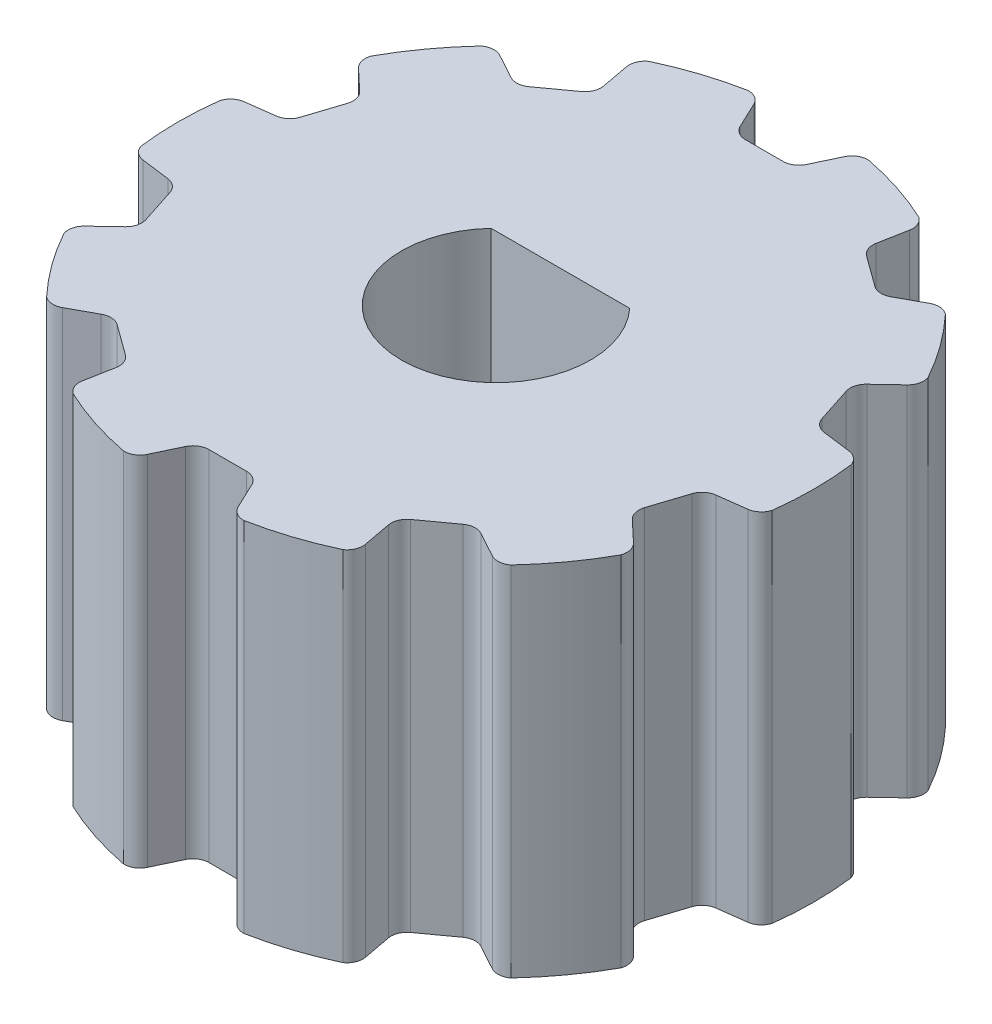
ISO-10303-21;
HEADER;
FILE_DESCRIPTION(('STEP AP214'),'2;1');
FILE_NAME('part.step','',(''),(''),'','','');
FILE_SCHEMA(('AUTOMOTIVE_DESIGN { 1 0 10303 214 1 1 1 1 }'));
ENDSEC;
DATA;
#1=APPLICATION_CONTEXT('core data for automotive mechanical design processes');
#2=APPLICATION_PROTOCOL_DEFINITION('international standard','automotive_design',2000,#1);
#3=PRODUCT_CONTEXT('',#1,'mechanical');
#4=PRODUCT('Part','Part','',(#3));
#5=PRODUCT_RELATED_PRODUCT_CATEGORY('part','',(#4));
#6=PRODUCT_DEFINITION_FORMATION('','',#4);
#7=PRODUCT_DEFINITION_CONTEXT('part definition',#1,'design');
#8=PRODUCT_DEFINITION('design','',#6,#7);
#9=PRODUCT_DEFINITION_SHAPE('','',#8);
#10=(LENGTH_UNIT() NAMED_UNIT(*) SI_UNIT(.MILLI.,.METRE.));
#11=(NAMED_UNIT(*) PLANE_ANGLE_UNIT() SI_UNIT($,.RADIAN.));
#12=(NAMED_UNIT(*) SI_UNIT($,.STERADIAN.) SOLID_ANGLE_UNIT());
#13=UNCERTAINTY_MEASURE_WITH_UNIT(LENGTH_MEASURE(1.E-05),#10,'distance_accuracy_value','');
#14=(GEOMETRIC_REPRESENTATION_CONTEXT(3) GLOBAL_UNCERTAINTY_ASSIGNED_CONTEXT((#13)) GLOBAL_UNIT_ASSIGNED_CONTEXT((#10,
#11,#12)) REPRESENTATION_CONTEXT('',''));
#15=CARTESIAN_POINT('',(0.,0.,0.));
#16=DIRECTION('',(0.,0.,1.));
#17=DIRECTION('',(1.,0.,0.));
#18=AXIS2_PLACEMENT_3D('',#15,#16,#17);
#19=CARTESIAN_POINT('',(0.,4.5,0.));
#20=DIRECTION('',(0.,-1.,0.));
#21=DIRECTION('',(0.,0.,-1.));
#22=AXIS2_PLACEMENT_3D('',#19,#20,#21);
#23=CYLINDRICAL_SURFACE('',#22,8.);
#24=CARTESIAN_POINT('',(0.,-4.5,0.));
#25=DIRECTION('',(0.,1.,0.));
#26=DIRECTION('',(0.,0.,1.));
#27=AXIS2_PLACEMENT_3D('',#24,#25,#26);
#28=CIRCLE('',#27,8.);
#29=CARTESIAN_POINT('',(7.00428283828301,-4.5,-3.86523245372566));
#30=VERTEX_POINT('',#29);
#31=CARTESIAN_POINT('',(5.84049694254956,-4.5,-5.46704631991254));
#32=VERTEX_POINT('',#31);
#33=EDGE_CURVE('E1179',#30,#32,#28,.T.);
#34=ORIENTED_EDGE('',*,*,#33,.T.);
#35=DIRECTION('',(0.,1.,0.));
#36=VECTOR('',#35,1.);
#37=CARTESIAN_POINT('',(5.84049694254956,-8.5,-5.46704631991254));
#38=LINE('',#37,#36);
#39=CARTESIAN_POINT('',(5.84049694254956,4.5,-5.46704631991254));
#40=VERTEX_POINT('',#39);
#41=EDGE_CURVE('E893',#32,#40,#38,.T.);
#42=ORIENTED_EDGE('',*,*,#41,.T.);
#43=CARTESIAN_POINT('',(0.,4.5,0.));
#44=DIRECTION('',(0.,1.,0.));
#45=DIRECTION('',(0.,0.,1.));
#46=AXIS2_PLACEMENT_3D('',#43,#44,#45);
#47=CIRCLE('',#46,8.);
#48=CARTESIAN_POINT('',(7.00428283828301,4.5,-3.86523245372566));
#49=VERTEX_POINT('',#48);
#50=EDGE_CURVE('E1175',#49,#40,#47,.T.);
#51=ORIENTED_EDGE('',*,*,#50,.F.);
#52=DIRECTION('',(0.,1.,0.));
#53=VECTOR('',#52,1.);
#54=CARTESIAN_POINT('',(7.00428283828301,-8.5,-3.86523245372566));
#55=LINE('',#54,#53);
#56=EDGE_CURVE('E884',#49,#30,#55,.F.);
#57=ORIENTED_EDGE('',*,*,#56,.T.);
#58=EDGE_LOOP('',(#34,#42,#51,#57));
#59=FACE_BOUND('',#58,.T.);
#60=ADVANCED_FACE('F33',(#59),#23,.T.);
#61=CARTESIAN_POINT('',(7.93851048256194,-4.5,0.989975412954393));
#62=VERTEX_POINT('',#61);
#63=CARTESIAN_POINT('',(7.93851048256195,-4.5,-0.989975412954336));
#64=VERTEX_POINT('',#63);
#65=EDGE_CURVE('E1180',#62,#64,#28,.T.);
#66=ORIENTED_EDGE('',*,*,#65,.T.);
#67=DIRECTION('',(0.,1.,0.));
#68=VECTOR('',#67,1.);
#69=CARTESIAN_POINT('',(7.93851048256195,-8.5,-0.989975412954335));
#70=LINE('',#69,#68);
#71=CARTESIAN_POINT('',(7.93851048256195,4.5,-0.989975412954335));
#72=VERTEX_POINT('',#71);
#73=EDGE_CURVE('E887',#64,#72,#70,.T.);
#74=ORIENTED_EDGE('',*,*,#73,.T.);
#75=CARTESIAN_POINT('',(7.93851048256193,4.5,0.989975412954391));
#76=VERTEX_POINT('',#75);
#77=EDGE_CURVE('E1201',#76,#72,#47,.T.);
#78=ORIENTED_EDGE('',*,*,#77,.F.);
#79=DIRECTION('',(0.,1.,0.));
#80=VECTOR('',#79,1.);
#81=CARTESIAN_POINT('',(7.93851048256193,-8.5,0.989975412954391));
#82=LINE('',#81,#80);
#83=EDGE_CURVE('E878',#76,#62,#82,.F.);
#84=ORIENTED_EDGE('',*,*,#83,.T.);
#85=EDGE_LOOP('',(#66,#74,#78,#84));
#86=FACE_BOUND('',#85,.T.);
#87=ADVANCED_FACE('F1409',(#86),#23,.T.);
#88=CARTESIAN_POINT('',(5.84049694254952,-4.5,5.46704631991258));
#89=VERTEX_POINT('',#88);
#90=CARTESIAN_POINT('',(7.00428283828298,-4.5,3.86523245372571));
#91=VERTEX_POINT('',#90);
#92=EDGE_CURVE('E1182',#89,#91,#28,.T.);
#93=ORIENTED_EDGE('',*,*,#92,.T.);
#94=DIRECTION('',(0.,1.,0.));
#95=VECTOR('',#94,1.);
#96=CARTESIAN_POINT('',(7.00428283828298,-8.5,3.86523245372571));
#97=LINE('',#96,#95);
#98=CARTESIAN_POINT('',(7.00428283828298,4.5,3.86523245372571));
#99=VERTEX_POINT('',#98);
#100=EDGE_CURVE('E881',#91,#99,#97,.T.);
#101=ORIENTED_EDGE('',*,*,#100,.T.);
#102=CARTESIAN_POINT('',(5.84049694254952,4.5,5.46704631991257));
#103=VERTEX_POINT('',#102);
#104=EDGE_CURVE('E1203',#103,#99,#47,.T.);
#105=ORIENTED_EDGE('',*,*,#104,.F.);
#106=DIRECTION('',(0.,1.,0.));
#107=VECTOR('',#106,1.);
#108=CARTESIAN_POINT('',(5.84049694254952,-8.5,5.46704631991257));
#109=LINE('',#108,#107);
#110=EDGE_CURVE('E872',#103,#89,#109,.F.);
#111=ORIENTED_EDGE('',*,*,#110,.T.);
#112=EDGE_LOOP('',(#93,#101,#105,#111));
#113=FACE_BOUND('',#112,.T.);
#114=ADVANCED_FACE('F1382',(#113),#23,.T.);
#115=CARTESIAN_POINT('',(1.51161208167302,-4.5,7.85589135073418));
#116=VERTEX_POINT('',#115);
#117=CARTESIAN_POINT('',(3.39465721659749,-4.5,7.24405289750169));
#118=VERTEX_POINT('',#117);
#119=EDGE_CURVE('E1355',#116,#118,#28,.T.);
#120=ORIENTED_EDGE('',*,*,#119,.T.);
#121=DIRECTION('',(0.,1.,0.));
#122=VECTOR('',#121,1.);
#123=CARTESIAN_POINT('',(3.39465721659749,-8.5,7.24405289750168));
#124=LINE('',#123,#122);
#125=CARTESIAN_POINT('',(3.39465721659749,4.5,7.24405289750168));
#126=VERTEX_POINT('',#125);
#127=EDGE_CURVE('E875',#118,#126,#124,.T.);
#128=ORIENTED_EDGE('',*,*,#127,.T.);
#129=CARTESIAN_POINT('',(1.51161208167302,4.5,7.85589135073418));
#130=VERTEX_POINT('',#129);
#131=EDGE_CURVE('E1208',#130,#126,#47,.T.);
#132=ORIENTED_EDGE('',*,*,#131,.F.);
#133=DIRECTION('',(0.,1.,0.));
#134=VECTOR('',#133,1.);
#135=CARTESIAN_POINT('',(1.51161208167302,-8.5,7.85589135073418));
#136=LINE('',#135,#134);
#137=EDGE_CURVE('E866',#130,#116,#136,.F.);
#138=ORIENTED_EDGE('',*,*,#137,.T.);
#139=EDGE_LOOP('',(#120,#128,#132,#138));
#140=FACE_BOUND('',#139,.T.);
#141=ADVANCED_FACE('F1353',(#140),#23,.T.);
#142=CARTESIAN_POINT('',(-3.3946572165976,-4.5,7.24405289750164));
#143=VERTEX_POINT('',#142);
#144=CARTESIAN_POINT('',(-1.51161208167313,-4.5,7.85589135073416));
#145=VERTEX_POINT('',#144);
#146=EDGE_CURVE('E1326',#143,#145,#28,.T.);
#147=ORIENTED_EDGE('',*,*,#146,.T.);
#148=DIRECTION('',(0.,1.,0.));
#149=VECTOR('',#148,1.);
#150=CARTESIAN_POINT('',(-1.51161208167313,-8.5,7.85589135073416));
#151=LINE('',#150,#149);
#152=CARTESIAN_POINT('',(-1.51161208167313,4.5,7.85589135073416));
#153=VERTEX_POINT('',#152);
#154=EDGE_CURVE('E869',#145,#153,#151,.T.);
#155=ORIENTED_EDGE('',*,*,#154,.T.);
#156=CARTESIAN_POINT('',(-3.39465721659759,4.5,7.24405289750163));
#157=VERTEX_POINT('',#156);
#158=EDGE_CURVE('E1213',#157,#153,#47,.T.);
#159=ORIENTED_EDGE('',*,*,#158,.F.);
#160=DIRECTION('',(0.,1.,0.));
#161=VECTOR('',#160,1.);
#162=CARTESIAN_POINT('',(-3.39465721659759,-8.5,7.24405289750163));
#163=LINE('',#162,#161);
#164=EDGE_CURVE('E860',#157,#143,#163,.F.);
#165=ORIENTED_EDGE('',*,*,#164,.T.);
#166=EDGE_LOOP('',(#147,#155,#159,#165));
#167=FACE_BOUND('',#166,.T.);
#168=ADVANCED_FACE('F1324',(#167),#23,.T.);
#169=CARTESIAN_POINT('',(-7.00428283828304,-4.5,3.86523245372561));
#170=VERTEX_POINT('',#169);
#171=CARTESIAN_POINT('',(-5.8404969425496,-4.5,5.4670463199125));
#172=VERTEX_POINT('',#171);
#173=EDGE_CURVE('E1297',#170,#172,#28,.T.);
#174=ORIENTED_EDGE('',*,*,#173,.T.);
#175=DIRECTION('',(0.,1.,0.));
#176=VECTOR('',#175,1.);
#177=CARTESIAN_POINT('',(-5.8404969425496,-8.5,5.46704631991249));
#178=LINE('',#177,#176);
#179=CARTESIAN_POINT('',(-5.8404969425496,4.5,5.46704631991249));
#180=VERTEX_POINT('',#179);
#181=EDGE_CURVE('E863',#172,#180,#178,.T.);
#182=ORIENTED_EDGE('',*,*,#181,.T.);
#183=CARTESIAN_POINT('',(-7.00428283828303,4.5,3.86523245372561));
#184=VERTEX_POINT('',#183);
#185=EDGE_CURVE('E1218',#184,#180,#47,.T.);
#186=ORIENTED_EDGE('',*,*,#185,.F.);
#187=DIRECTION('',(0.,1.,0.));
#188=VECTOR('',#187,1.);
#189=CARTESIAN_POINT('',(-7.00428283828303,-8.5,3.86523245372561));
#190=LINE('',#189,#188);
#191=EDGE_CURVE('E854',#184,#170,#190,.F.);
#192=ORIENTED_EDGE('',*,*,#191,.T.);
#193=EDGE_LOOP('',(#174,#182,#186,#192));
#194=FACE_BOUND('',#193,.T.);
#195=ADVANCED_FACE('F1295',(#194),#23,.T.);
#196=CARTESIAN_POINT('',(-7.93851048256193,-4.5,-0.989975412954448));
#197=VERTEX_POINT('',#196);
#198=CARTESIAN_POINT('',(-7.93851048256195,-4.5,0.989975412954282));
#199=VERTEX_POINT('',#198);
#200=EDGE_CURVE('E1268',#197,#199,#28,.T.);
#201=ORIENTED_EDGE('',*,*,#200,.T.);
#202=DIRECTION('',(0.,1.,0.));
#203=VECTOR('',#202,1.);
#204=CARTESIAN_POINT('',(-7.93851048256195,-8.5,0.989975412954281));
#205=LINE('',#204,#203);
#206=CARTESIAN_POINT('',(-7.93851048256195,4.5,0.989975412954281));
#207=VERTEX_POINT('',#206);
#208=EDGE_CURVE('E857',#199,#207,#205,.T.);
#209=ORIENTED_EDGE('',*,*,#208,.T.);
#210=CARTESIAN_POINT('',(-7.93851048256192,4.5,-0.989975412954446));
#211=VERTEX_POINT('',#210);
#212=EDGE_CURVE('E1223',#211,#207,#47,.T.);
#213=ORIENTED_EDGE('',*,*,#212,.F.);
#214=DIRECTION('',(0.,1.,0.));
#215=VECTOR('',#214,1.);
#216=CARTESIAN_POINT('',(-7.93851048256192,-8.5,-0.989975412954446));
#217=LINE('',#216,#215);
#218=EDGE_CURVE('E848',#211,#197,#217,.F.);
#219=ORIENTED_EDGE('',*,*,#218,.T.);
#220=EDGE_LOOP('',(#201,#209,#213,#219));
#221=FACE_BOUND('',#220,.T.);
#222=ADVANCED_FACE('F1266',(#221),#23,.T.);
#223=CARTESIAN_POINT('',(-5.84049694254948,-4.5,-5.46704631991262));
#224=VERTEX_POINT('',#223);
#225=CARTESIAN_POINT('',(-7.00428283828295,-4.5,-3.86523245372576));
#226=VERTEX_POINT('',#225);
#227=EDGE_CURVE('E945',#224,#226,#28,.T.);
#228=ORIENTED_EDGE('',*,*,#227,.T.);
#229=DIRECTION('',(0.,1.,0.));
#230=VECTOR('',#229,1.);
#231=CARTESIAN_POINT('',(-7.00428283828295,-8.5,-3.86523245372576));
#232=LINE('',#231,#230);
#233=CARTESIAN_POINT('',(-7.00428283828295,4.5,-3.86523245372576));
#234=VERTEX_POINT('',#233);
#235=EDGE_CURVE('E851',#226,#234,#232,.T.);
#236=ORIENTED_EDGE('',*,*,#235,.T.);
#237=CARTESIAN_POINT('',(-5.84049694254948,4.5,-5.46704631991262));
#238=VERTEX_POINT('',#237);
#239=EDGE_CURVE('E940',#238,#234,#47,.T.);
#240=ORIENTED_EDGE('',*,*,#239,.F.);
#241=DIRECTION('',(0.,1.,0.));
#242=VECTOR('',#241,1.);
#243=CARTESIAN_POINT('',(-5.84049694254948,-8.5,-5.46704631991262));
#244=LINE('',#243,#242);
#245=EDGE_CURVE('E833',#238,#224,#244,.F.);
#246=ORIENTED_EDGE('',*,*,#245,.T.);
#247=EDGE_LOOP('',(#228,#236,#240,#246));
#248=FACE_BOUND('',#247,.T.);
#249=ADVANCED_FACE('F1239',(#248),#23,.T.);
#250=CARTESIAN_POINT('',(-1.51161208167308,-4.5,-7.85589135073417));
#251=VERTEX_POINT('',#250);
#252=CARTESIAN_POINT('',(-3.39465721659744,-4.5,-7.24405289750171));
#253=VERTEX_POINT('',#252);
#254=EDGE_CURVE('E942',#251,#253,#28,.T.);
#255=ORIENTED_EDGE('',*,*,#254,.T.);
#256=DIRECTION('',(0.,1.,0.));
#257=VECTOR('',#256,1.);
#258=CARTESIAN_POINT('',(-3.39465721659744,-8.5,-7.24405289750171));
#259=LINE('',#258,#257);
#260=CARTESIAN_POINT('',(-3.39465721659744,4.5,-7.24405289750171));
#261=VERTEX_POINT('',#260);
#262=EDGE_CURVE('E845',#253,#261,#259,.T.);
#263=ORIENTED_EDGE('',*,*,#262,.T.);
#264=CARTESIAN_POINT('',(-1.51161208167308,4.5,-7.85589135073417));
#265=VERTEX_POINT('',#264);
#266=EDGE_CURVE('E936',#265,#261,#47,.T.);
#267=ORIENTED_EDGE('',*,*,#266,.F.);
#268=DIRECTION('',(0.,1.,0.));
#269=VECTOR('',#268,1.);
#270=CARTESIAN_POINT('',(-1.51161208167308,-8.5,-7.85589135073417));
#271=LINE('',#270,#269);
#272=EDGE_CURVE('E920',#265,#251,#271,.F.);
#273=ORIENTED_EDGE('',*,*,#272,.T.);
#274=EDGE_LOOP('',(#255,#263,#267,#273));
#275=FACE_BOUND('',#274,.T.);
#276=ADVANCED_FACE('F1450',(#275),#23,.T.);
#277=CARTESIAN_POINT('',(3.39465721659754,4.5,-7.24405289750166));
#278=VERTEX_POINT('',#277);
#279=CARTESIAN_POINT('',(1.51161208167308,4.5,-7.85589135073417));
#280=VERTEX_POINT('',#279);
#281=EDGE_CURVE('E941',#278,#280,#47,.T.);
#282=ORIENTED_EDGE('',*,*,#281,.F.);
#283=DIRECTION('',(0.,1.,0.));
#284=VECTOR('',#283,1.);
#285=CARTESIAN_POINT('',(3.39465721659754,-8.5,-7.24405289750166));
#286=LINE('',#285,#284);
#287=CARTESIAN_POINT('',(3.39465721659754,-4.5,-7.24405289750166));
#288=VERTEX_POINT('',#287);
#289=EDGE_CURVE('E890',#278,#288,#286,.F.);
#290=ORIENTED_EDGE('',*,*,#289,.T.);
#291=CARTESIAN_POINT('',(1.51161208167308,-4.5,-7.85589135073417));
#292=VERTEX_POINT('',#291);
#293=EDGE_CURVE('E935',#288,#292,#28,.T.);
#294=ORIENTED_EDGE('',*,*,#293,.T.);
#295=DIRECTION('',(0.,1.,0.));
#296=VECTOR('',#295,1.);
#297=CARTESIAN_POINT('',(1.51161208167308,-8.5,-7.85589135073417));
#298=LINE('',#297,#296);
#299=EDGE_CURVE('E932',#292,#280,#298,.T.);
#300=ORIENTED_EDGE('',*,*,#299,.T.);
#301=EDGE_LOOP('',(#282,#290,#294,#300));
#302=FACE_BOUND('',#301,.T.);
#303=ADVANCED_FACE('F35',(#302),#23,.T.);
#304=CARTESIAN_POINT('',(0.,4.5,0.));
#305=DIRECTION('',(0.,1.,0.));
#306=DIRECTION('',(0.,0.,1.));
#307=AXIS2_PLACEMENT_3D('',#304,#305,#306);
#308=PLANE('',#307);
#309=CARTESIAN_POINT('',(0.,4.5,0.));
#310=DIRECTION('',(0.,1.,0.));
#311=DIRECTION('',(0.,0.,1.));
#312=AXIS2_PLACEMENT_3D('',#309,#310,#311);
#313=CIRCLE('',#312,2.38);
#314=CARTESIAN_POINT('',(-1.74355957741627,4.5,-1.62));
#315=VERTEX_POINT('',#314);
#316=CARTESIAN_POINT('',(1.74355957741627,4.5,-1.62));
#317=VERTEX_POINT('',#316);
#318=EDGE_CURVE('E48',#315,#317,#313,.T.);
#319=ORIENTED_EDGE('',*,*,#318,.F.);
#320=DIRECTION('',(-1.,0.,0.));
#321=VECTOR('',#320,1.);
#322=CARTESIAN_POINT('',(1.74355957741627,4.5,-1.62));
#323=LINE('',#322,#321);
#324=EDGE_CURVE('E546',#317,#315,#323,.T.);
#325=ORIENTED_EDGE('',*,*,#324,.F.);
#326=EDGE_LOOP('',(#319,#325));
#327=FACE_BOUND('',#326,.T.);
#328=CARTESIAN_POINT('',(5.59826926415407,4.5,-5.1487292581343));
#329=DIRECTION('',(0.,-1.,0.));
#330=DIRECTION('',(0.587785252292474,0.,-0.809016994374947));
#331=AXIS2_PLACEMENT_3D('',#328,#329,#330);
#332=CIRCLE('',#331,0.400000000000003);
#333=CARTESIAN_POINT('',(5.4066997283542,4.5,-5.49987184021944));
#334=VERTEX_POINT('',#333);
#335=EDGE_CURVE('E801',#334,#40,#332,.T.);
#336=ORIENTED_EDGE('',*,*,#335,.F.);
#337=DIRECTION('',(0.877856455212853,0.,-0.47892383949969));
#338=VECTOR('',#337,1.);
#339=CARTESIAN_POINT('',(5.4066997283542,4.5,-5.49987184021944));
#340=LINE('',#339,#338);
#341=CARTESIAN_POINT('',(4.77613583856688,4.5,-5.15586106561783));
#342=VERTEX_POINT('',#341);
#343=EDGE_CURVE('E827',#342,#334,#340,.T.);
#344=ORIENTED_EDGE('',*,*,#343,.F.);
#345=CARTESIAN_POINT('',(4.584566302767,4.5,-5.50700364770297));
#346=DIRECTION('',(0.,1.,0.));
#347=DIRECTION('',(0.587785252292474,0.,-0.809016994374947));
#348=AXIS2_PLACEMENT_3D('',#345,#346,#347);
#349=CIRCLE('',#348,0.399999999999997);
#350=CARTESIAN_POINT('',(4.34945220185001,4.5,-5.18339684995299));
#351=VERTEX_POINT('',#350);
#352=EDGE_CURVE('E824',#351,#342,#349,.T.);
#353=ORIENTED_EDGE('',*,*,#352,.F.);
#354=DIRECTION('',(0.809016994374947,0.,0.587785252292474));
#355=VECTOR('',#354,1.);
#356=CARTESIAN_POINT('',(4.34945220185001,4.5,-5.18339684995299));
#357=LINE('',#356,#355);
#358=CARTESIAN_POINT('',(3.58564870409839,4.5,-5.73833257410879));
#359=VERTEX_POINT('',#358);
#360=EDGE_CURVE('E821',#359,#351,#357,.T.);
#361=ORIENTED_EDGE('',*,*,#360,.F.);
#362=CARTESIAN_POINT('',(3.82076280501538,4.5,-6.06193937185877));
#363=DIRECTION('',(0.,1.,0.));
#364=DIRECTION('',(-0.587785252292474,0.,0.809016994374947));
#365=AXIS2_PLACEMENT_3D('',#362,#363,#364);
#366=CIRCLE('',#365,0.399999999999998);
#367=CARTESIAN_POINT('',(3.42760812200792,4.5,-6.13562380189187));
#368=VERTEX_POINT('',#367);
#369=EDGE_CURVE('E818',#368,#359,#366,.T.);
#370=ORIENTED_EDGE('',*,*,#369,.F.);
#371=DIRECTION('',(-0.184211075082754,0.,0.982886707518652));
#372=VECTOR('',#371,1.);
#373=CARTESIAN_POINT('',(3.55992685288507,4.5,-6.8416308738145));
#374=LINE('',#373,#372);
#375=CARTESIAN_POINT('',(3.55992685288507,4.5,-6.8416308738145));
#376=VERTEX_POINT('',#375);
#377=EDGE_CURVE('E815',#376,#368,#374,.T.);
#378=ORIENTED_EDGE('',*,*,#377,.F.);
#379=CARTESIAN_POINT('',(3.16677216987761,4.5,-6.91531530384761));
#380=DIRECTION('',(0.,-1.,0.));
#381=DIRECTION('',(-0.587785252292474,0.,0.809016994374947));
#382=AXIS2_PLACEMENT_3D('',#379,#380,#381);
#383=CIRCLE('',#382,0.399999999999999);
#384=EDGE_CURVE('E812',#278,#376,#383,.T.);
#385=ORIENTED_EDGE('',*,*,#384,.F.);
#386=ORIENTED_EDGE('',*,*,#281,.T.);
#387=CARTESIAN_POINT('',(1.50274784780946,4.5,-7.45598958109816));
#388=DIRECTION('',(0.,-1.,0.));
#389=DIRECTION('',(0.,0.,-1.));
#390=AXIS2_PLACEMENT_3D('',#387,#388,#389);
#391=CIRCLE('',#390,0.400000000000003);
#392=CARTESIAN_POINT('',(1.14136840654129,4.5,-7.62746814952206));
#393=VERTEX_POINT('',#392);
#394=EDGE_CURVE('E896',#393,#280,#391,.T.);
#395=ORIENTED_EDGE('',*,*,#394,.F.);
#396=DIRECTION('',(0.428696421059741,0.,-0.903448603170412));
#397=VECTOR('',#396,1.);
#398=CARTESIAN_POINT('',(1.14136840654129,4.5,-7.62746814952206));
#399=LINE('',#398,#397);
#400=CARTESIAN_POINT('',(0.833435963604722,4.5,-6.9785214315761));
#401=VERTEX_POINT('',#400);
#402=EDGE_CURVE('E914',#401,#393,#399,.T.);
#403=ORIENTED_EDGE('',*,*,#402,.F.);
#404=CARTESIAN_POINT('',(0.472056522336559,4.5,-7.15));
#405=DIRECTION('',(0.,1.,0.));
#406=DIRECTION('',(0.,0.,-1.));
#407=AXIS2_PLACEMENT_3D('',#404,#405,#406);
#408=CIRCLE('',#407,0.399999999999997);
#409=CARTESIAN_POINT('',(0.472056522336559,4.5,-6.75));
#410=VERTEX_POINT('',#409);
#411=EDGE_CURVE('E911',#410,#401,#408,.T.);
#412=ORIENTED_EDGE('',*,*,#411,.F.);
#413=DIRECTION('',(1.,0.,0.));
#414=VECTOR('',#413,1.);
#415=CARTESIAN_POINT('',(0.472056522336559,4.5,-6.75));
#416=LINE('',#415,#414);
#417=CARTESIAN_POINT('',(-0.472056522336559,4.5,-6.75));
#418=VERTEX_POINT('',#417);
#419=EDGE_CURVE('E908',#418,#410,#416,.T.);
#420=ORIENTED_EDGE('',*,*,#419,.F.);
#421=CARTESIAN_POINT('',(-0.472056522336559,4.5,-7.15));
#422=DIRECTION('',(0.,1.,0.));
#423=DIRECTION('',(0.,0.,1.));
#424=AXIS2_PLACEMENT_3D('',#421,#422,#423);
#425=CIRCLE('',#424,0.399999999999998);
#426=CARTESIAN_POINT('',(-0.833435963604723,4.5,-6.9785214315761));
#427=VERTEX_POINT('',#426);
#428=EDGE_CURVE('E905',#427,#418,#425,.T.);
#429=ORIENTED_EDGE('',*,*,#428,.F.);
#430=DIRECTION('',(0.428696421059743,0.,0.903448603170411));
#431=VECTOR('',#430,1.);
#432=CARTESIAN_POINT('',(-1.14136840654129,4.5,-7.62746814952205));
#433=LINE('',#432,#431);
#434=CARTESIAN_POINT('',(-1.14136840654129,4.5,-7.62746814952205));
#435=VERTEX_POINT('',#434);
#436=EDGE_CURVE('E902',#435,#427,#433,.T.);
#437=ORIENTED_EDGE('',*,*,#436,.F.);
#438=CARTESIAN_POINT('',(-1.50274784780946,4.5,-7.45598958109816));
#439=DIRECTION('',(0.,-1.,0.));
#440=DIRECTION('',(0.,0.,1.));
#441=AXIS2_PLACEMENT_3D('',#438,#439,#440);
#442=CIRCLE('',#441,0.399999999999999);
#443=EDGE_CURVE('E899',#265,#435,#442,.T.);
#444=ORIENTED_EDGE('',*,*,#443,.F.);
#445=ORIENTED_EDGE('',*,*,#266,.T.);
#446=CARTESIAN_POINT('',(-3.16677216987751,4.5,-6.91531530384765));
#447=DIRECTION('',(0.,-1.,0.));
#448=DIRECTION('',(-0.587785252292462,0.,-0.809016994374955));
#449=AXIS2_PLACEMENT_3D('',#446,#447,#448);
#450=CIRCLE('',#449,0.400000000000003);
#451=CARTESIAN_POINT('',(-3.55992685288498,4.5,-6.84163087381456));
#452=VERTEX_POINT('',#451);
#453=EDGE_CURVE('E542',#452,#261,#450,.T.);
#454=ORIENTED_EDGE('',*,*,#453,.F.);
#455=DIRECTION('',(-0.184211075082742,0.,-0.982886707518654));
#456=VECTOR('',#455,1.);
#457=CARTESIAN_POINT('',(-3.55992685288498,4.5,-6.84163087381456));
#458=LINE('',#457,#456);
#459=CARTESIAN_POINT('',(-3.42760812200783,4.5,-6.13562380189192));
#460=VERTEX_POINT('',#459);
#461=EDGE_CURVE('E571',#460,#452,#458,.T.);
#462=ORIENTED_EDGE('',*,*,#461,.F.);
#463=CARTESIAN_POINT('',(-3.82076280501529,4.5,-6.06193937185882));
#464=DIRECTION('',(0.,1.,0.));
#465=DIRECTION('',(-0.587785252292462,0.,-0.809016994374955));
#466=AXIS2_PLACEMENT_3D('',#463,#464,#465);
#467=CIRCLE('',#466,0.399999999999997);
#468=CARTESIAN_POINT('',(-3.5856487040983,4.5,-5.73833257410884));
#469=VERTEX_POINT('',#468);
#470=EDGE_CURVE('E568',#469,#460,#467,.T.);
#471=ORIENTED_EDGE('',*,*,#470,.F.);
#472=DIRECTION('',(0.809016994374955,0.,-0.587785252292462));
#473=VECTOR('',#472,1.);
#474=CARTESIAN_POINT('',(-3.5856487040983,4.5,-5.73833257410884));
#475=LINE('',#474,#473);
#476=CARTESIAN_POINT('',(-4.34945220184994,4.5,-5.18339684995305));
#477=VERTEX_POINT('',#476);
#478=EDGE_CURVE('E565',#477,#469,#475,.T.);
#479=ORIENTED_EDGE('',*,*,#478,.F.);
#480=CARTESIAN_POINT('',(-4.58456630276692,4.5,-5.50700364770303));
#481=DIRECTION('',(0.,1.,0.));
#482=DIRECTION('',(0.587785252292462,0.,0.809016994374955));
#483=AXIS2_PLACEMENT_3D('',#480,#481,#482);
#484=CIRCLE('',#483,0.399999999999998);
#485=CARTESIAN_POINT('',(-4.7761358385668,4.5,-5.15586106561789));
#486=VERTEX_POINT('',#485);
#487=EDGE_CURVE('E562',#486,#477,#484,.T.);
#488=ORIENTED_EDGE('',*,*,#487,.F.);
#489=DIRECTION('',(0.877856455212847,0.,0.478923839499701));
#490=VECTOR('',#489,1.);
#491=CARTESIAN_POINT('',(-5.40669972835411,4.5,-5.49987184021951));
#492=LINE('',#491,#490);
#493=CARTESIAN_POINT('',(-5.40669972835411,4.5,-5.49987184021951));
#494=VERTEX_POINT('',#493);
#495=EDGE_CURVE('E559',#494,#486,#492,.T.);
#496=ORIENTED_EDGE('',*,*,#495,.F.);
#497=CARTESIAN_POINT('',(-5.59826926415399,4.5,-5.14872925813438));
#498=DIRECTION('',(0.,-1.,0.));
#499=DIRECTION('',(0.587785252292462,0.,0.809016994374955));
#500=AXIS2_PLACEMENT_3D('',#497,#498,#499);
#501=CIRCLE('',#500,0.399999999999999);
#502=EDGE_CURVE('E556',#238,#494,#501,.T.);
#503=ORIENTED_EDGE('',*,*,#502,.F.);
#504=ORIENTED_EDGE('',*,*,#239,.T.);
#505=CARTESIAN_POINT('',(-6.62669285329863,4.5,-3.73322562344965));
#506=DIRECTION('',(0.,-1.,0.));
#507=DIRECTION('',(-0.95105651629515,0.,-0.309016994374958));
#508=AXIS2_PLACEMENT_3D('',#505,#506,#507);
#509=CIRCLE('',#508,0.400000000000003);
#510=CARTESIAN_POINT('',(-6.90145105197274,4.5,-3.44252314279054));
#511=VERTEX_POINT('',#510);
#512=EDGE_CURVE('E577',#511,#234,#509,.T.);
#513=ORIENTED_EDGE('',*,*,#512,.F.);
#514=DIRECTION('',(-0.726756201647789,0.,-0.686895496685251));
#515=VECTOR('',#514,1.);
#516=CARTESIAN_POINT('',(-6.90145105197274,4.5,-3.44252314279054));
#517=LINE('',#516,#515);
#518=CARTESIAN_POINT('',(-6.37942240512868,4.5,-2.94912642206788));
#519=VERTEX_POINT('',#518);
#520=EDGE_CURVE('E603',#519,#511,#517,.T.);
#521=ORIENTED_EDGE('',*,*,#520,.F.);
#522=CARTESIAN_POINT('',(-6.65418060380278,4.5,-2.65842394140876));
#523=DIRECTION('',(0.,1.,0.));
#524=DIRECTION('',(-0.95105651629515,0.,-0.309016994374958));
#525=AXIS2_PLACEMENT_3D('',#522,#523,#524);
#526=CIRCLE('',#525,0.399999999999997);
#527=CARTESIAN_POINT('',(-6.27375799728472,4.5,-2.53481714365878));
#528=VERTEX_POINT('',#527);
#529=EDGE_CURVE('E600',#528,#519,#526,.T.);
#530=ORIENTED_EDGE('',*,*,#529,.F.);
#531=DIRECTION('',(0.309016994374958,0.,-0.95105651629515));
#532=VECTOR('',#531,1.);
#533=CARTESIAN_POINT('',(-6.27375799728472,4.5,-2.53481714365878));
#534=LINE('',#533,#532);
#535=CARTESIAN_POINT('',(-6.5655049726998,4.5,-1.63691228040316));
#536=VERTEX_POINT('',#535);
#537=EDGE_CURVE('E597',#536,#528,#534,.T.);
#538=ORIENTED_EDGE('',*,*,#537,.F.);
#539=CARTESIAN_POINT('',(-6.94592757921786,4.5,-1.76051907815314));
#540=DIRECTION('',(0.,1.,0.));
#541=DIRECTION('',(0.95105651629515,0.,0.309016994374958));
#542=AXIS2_PLACEMENT_3D('',#539,#540,#541);
#543=CIRCLE('',#542,0.399999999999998);
#544=CARTESIAN_POINT('',(-6.89451415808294,4.5,-1.36383701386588));
#545=VERTEX_POINT('',#544);
#546=EDGE_CURVE('E594',#545,#536,#543,.T.);
#547=ORIENTED_EDGE('',*,*,#546,.F.);
#548=DIRECTION('',(0.991705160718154,0.,-0.128533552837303));
#549=VECTOR('',#548,1.);
#550=CARTESIAN_POINT('',(-7.60685552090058,4.5,-1.27151142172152));
#551=LINE('',#550,#549);
#552=CARTESIAN_POINT('',(-7.60685552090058,4.5,-1.27151142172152));
#553=VERTEX_POINT('',#552);
#554=EDGE_CURVE('E591',#553,#545,#551,.T.);
#555=ORIENTED_EDGE('',*,*,#554,.F.);
#556=CARTESIAN_POINT('',(-7.55544209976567,4.5,-0.87482935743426));
#557=DIRECTION('',(0.,-1.,0.));
#558=DIRECTION('',(0.95105651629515,0.,0.309016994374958));
#559=AXIS2_PLACEMENT_3D('',#556,#557,#558);
#560=CIRCLE('',#559,0.399999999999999);
#561=EDGE_CURVE('E588',#211,#553,#560,.T.);
#562=ORIENTED_EDGE('',*,*,#561,.F.);
#563=ORIENTED_EDGE('',*,*,#212,.T.);
#564=CARTESIAN_POINT('',(-7.55544209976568,4.5,0.874829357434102));
#565=DIRECTION('',(0.,-1.,0.));
#566=DIRECTION('',(-0.951056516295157,0.,0.309016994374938));
#567=AXIS2_PLACEMENT_3D('',#564,#565,#566);
#568=CIRCLE('',#567,0.400000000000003);
#569=CARTESIAN_POINT('',(-7.60685552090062,4.5,1.27151142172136));
#570=VERTEX_POINT('',#569);
#571=EDGE_CURVE('E609',#570,#207,#568,.T.);
#572=ORIENTED_EDGE('',*,*,#571,.F.);
#573=DIRECTION('',(-0.991705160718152,0.,-0.128533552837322));
#574=VECTOR('',#573,1.);
#575=CARTESIAN_POINT('',(-7.60685552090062,4.5,1.27151142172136));
#576=LINE('',#575,#574);
#577=CARTESIAN_POINT('',(-6.89451415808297,4.5,1.36383701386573));
#578=VERTEX_POINT('',#577);
#579=EDGE_CURVE('E635',#578,#570,#576,.T.);
#580=ORIENTED_EDGE('',*,*,#579,.F.);
#581=CARTESIAN_POINT('',(-6.9459275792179,4.5,1.76051907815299));
#582=DIRECTION('',(0.,1.,0.));
#583=DIRECTION('',(-0.951056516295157,0.,0.309016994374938));
#584=AXIS2_PLACEMENT_3D('',#581,#582,#583);
#585=CIRCLE('',#584,0.399999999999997);
#586=CARTESIAN_POINT('',(-6.56550497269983,4.5,1.63691228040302));
#587=VERTEX_POINT('',#586);
#588=EDGE_CURVE('E632',#587,#578,#585,.T.);
#589=ORIENTED_EDGE('',*,*,#588,.F.);
#590=DIRECTION('',(-0.309016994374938,0.,-0.951056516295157));
#591=VECTOR('',#590,1.);
#592=CARTESIAN_POINT('',(-6.56550497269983,4.5,1.63691228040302));
#593=LINE('',#592,#591);
#594=CARTESIAN_POINT('',(-6.27375799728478,4.5,2.53481714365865));
#595=VERTEX_POINT('',#594);
#596=EDGE_CURVE('E629',#595,#587,#593,.T.);
#597=ORIENTED_EDGE('',*,*,#596,.F.);
#598=CARTESIAN_POINT('',(-6.65418060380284,4.5,2.65842394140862));
#599=DIRECTION('',(0.,1.,0.));
#600=DIRECTION('',(0.951056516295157,0.,-0.309016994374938));
#601=AXIS2_PLACEMENT_3D('',#598,#599,#600);
#602=CIRCLE('',#601,0.399999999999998);
#603=CARTESIAN_POINT('',(-6.37942240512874,4.5,2.94912642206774));
#604=VERTEX_POINT('',#603);
#605=EDGE_CURVE('E626',#604,#595,#602,.T.);
#606=ORIENTED_EDGE('',*,*,#605,.F.);
#607=DIRECTION('',(0.726756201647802,0.,-0.686895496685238));
#608=VECTOR('',#607,1.);
#609=CARTESIAN_POINT('',(-6.9014510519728,4.5,3.44252314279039));
#610=LINE('',#609,#608);
#611=CARTESIAN_POINT('',(-6.9014510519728,4.5,3.44252314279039));
#612=VERTEX_POINT('',#611);
#613=EDGE_CURVE('E623',#612,#604,#610,.T.);
#614=ORIENTED_EDGE('',*,*,#613,.F.);
#615=CARTESIAN_POINT('',(-6.62669285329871,4.5,3.73322562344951));
#616=DIRECTION('',(0.,-1.,0.));
#617=DIRECTION('',(0.951056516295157,0.,-0.309016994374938));
#618=AXIS2_PLACEMENT_3D('',#615,#616,#617);
#619=CIRCLE('',#618,0.399999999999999);
#620=EDGE_CURVE('E620',#184,#612,#619,.T.);
#621=ORIENTED_EDGE('',*,*,#620,.F.);
#622=ORIENTED_EDGE('',*,*,#185,.T.);
#623=CARTESIAN_POINT('',(-5.5982692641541,4.5,5.14872925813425));
#624=DIRECTION('',(0.,-1.,0.));
#625=DIRECTION('',(-0.58778525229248,0.,0.809016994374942));
#626=AXIS2_PLACEMENT_3D('',#623,#624,#625);
#627=CIRCLE('',#626,0.400000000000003);
#628=CARTESIAN_POINT('',(-5.40669972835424,4.5,5.4998718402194));
#629=VERTEX_POINT('',#628);
#630=EDGE_CURVE('E641',#629,#180,#627,.T.);
#631=ORIENTED_EDGE('',*,*,#630,.F.);
#632=DIRECTION('',(-0.877856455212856,0.,0.478923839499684));
#633=VECTOR('',#632,1.);
#634=CARTESIAN_POINT('',(-5.40669972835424,4.5,5.4998718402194));
#635=LINE('',#634,#633);
#636=CARTESIAN_POINT('',(-4.77613583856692,4.5,5.15586106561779));
#637=VERTEX_POINT('',#636);
#638=EDGE_CURVE('E667',#637,#629,#635,.T.);
#639=ORIENTED_EDGE('',*,*,#638,.F.);
#640=CARTESIAN_POINT('',(-4.58456630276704,4.5,5.50700364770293));
#641=DIRECTION('',(0.,1.,0.));
#642=DIRECTION('',(-0.58778525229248,0.,0.809016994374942));
#643=AXIS2_PLACEMENT_3D('',#640,#641,#642);
#644=CIRCLE('',#643,0.399999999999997);
#645=CARTESIAN_POINT('',(-4.34945220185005,4.5,5.18339684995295));
#646=VERTEX_POINT('',#645);
#647=EDGE_CURVE('E664',#646,#637,#644,.T.);
#648=ORIENTED_EDGE('',*,*,#647,.F.);
#649=DIRECTION('',(-0.809016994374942,0.,-0.58778525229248));
#650=VECTOR('',#649,1.);
#651=CARTESIAN_POINT('',(-4.34945220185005,4.5,5.18339684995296));
#652=LINE('',#651,#650);
#653=CARTESIAN_POINT('',(-3.58564870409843,4.5,5.73833257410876));
#654=VERTEX_POINT('',#653);
#655=EDGE_CURVE('E661',#654,#646,#652,.T.);
#656=ORIENTED_EDGE('',*,*,#655,.F.);
#657=CARTESIAN_POINT('',(-3.82076280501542,4.5,6.06193937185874));
#658=DIRECTION('',(0.,1.,0.));
#659=DIRECTION('',(0.58778525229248,0.,-0.809016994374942));
#660=AXIS2_PLACEMENT_3D('',#657,#658,#659);
#661=CIRCLE('',#660,0.399999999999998);
#662=CARTESIAN_POINT('',(-3.42760812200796,4.5,6.13562380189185));
#663=VERTEX_POINT('',#662);
#664=EDGE_CURVE('E658',#663,#654,#661,.T.);
#665=ORIENTED_EDGE('',*,*,#664,.F.);
#666=DIRECTION('',(0.184211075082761,0.,-0.982886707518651));
#667=VECTOR('',#666,1.);
#668=CARTESIAN_POINT('',(-3.55992685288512,4.5,6.84163087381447));
#669=LINE('',#668,#667);
#670=CARTESIAN_POINT('',(-3.55992685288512,4.5,6.84163087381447));
#671=VERTEX_POINT('',#670);
#672=EDGE_CURVE('E655',#671,#663,#669,.T.);
#673=ORIENTED_EDGE('',*,*,#672,.F.);
#674=CARTESIAN_POINT('',(-3.16677216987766,4.5,6.91531530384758));
#675=DIRECTION('',(0.,-1.,0.));
#676=DIRECTION('',(0.58778525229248,0.,-0.809016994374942));
#677=AXIS2_PLACEMENT_3D('',#674,#675,#676);
#678=CIRCLE('',#677,0.399999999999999);
#679=EDGE_CURVE('E652',#157,#671,#678,.T.);
#680=ORIENTED_EDGE('',*,*,#679,.F.);
#681=ORIENTED_EDGE('',*,*,#158,.T.);
#682=CARTESIAN_POINT('',(-1.50274784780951,4.5,7.45598958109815));
#683=DIRECTION('',(0.,-1.,0.));
#684=DIRECTION('',(0.,0.,1.));
#685=AXIS2_PLACEMENT_3D('',#682,#683,#684);
#686=CIRCLE('',#685,0.400000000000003);
#687=CARTESIAN_POINT('',(-1.14136840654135,4.5,7.62746814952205));
#688=VERTEX_POINT('',#687);
#689=EDGE_CURVE('E673',#688,#153,#686,.T.);
#690=ORIENTED_EDGE('',*,*,#689,.F.);
#691=DIRECTION('',(-0.428696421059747,0.,0.903448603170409));
#692=VECTOR('',#691,1.);
#693=CARTESIAN_POINT('',(-1.14136840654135,4.5,7.62746814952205));
#694=LINE('',#693,#692);
#695=CARTESIAN_POINT('',(-0.833435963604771,4.5,6.9785214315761));
#696=VERTEX_POINT('',#695);
#697=EDGE_CURVE('E699',#696,#688,#694,.T.);
#698=ORIENTED_EDGE('',*,*,#697,.F.);
#699=CARTESIAN_POINT('',(-0.472056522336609,4.5,7.14999999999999));
#700=DIRECTION('',(0.,1.,0.));
#701=DIRECTION('',(0.,0.,1.));
#702=AXIS2_PLACEMENT_3D('',#699,#700,#701);
#703=CIRCLE('',#702,0.399999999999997);
#704=CARTESIAN_POINT('',(-0.472056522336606,4.5,6.75));
#705=VERTEX_POINT('',#704);
#706=EDGE_CURVE('E696',#705,#696,#703,.T.);
#707=ORIENTED_EDGE('',*,*,#706,.F.);
#708=DIRECTION('',(-1.,0.,0.));
#709=VECTOR('',#708,1.);
#710=CARTESIAN_POINT('',(-0.472056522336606,4.5,6.75));
#711=LINE('',#710,#709);
#712=CARTESIAN_POINT('',(0.472056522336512,4.5,6.75));
#713=VERTEX_POINT('',#712);
#714=EDGE_CURVE('E693',#713,#705,#711,.T.);
#715=ORIENTED_EDGE('',*,*,#714,.F.);
#716=CARTESIAN_POINT('',(0.472056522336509,4.5,7.15));
#717=DIRECTION('',(0.,1.,0.));
#718=DIRECTION('',(0.,0.,-1.));
#719=AXIS2_PLACEMENT_3D('',#716,#717,#718);
#720=CIRCLE('',#719,0.399999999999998);
#721=CARTESIAN_POINT('',(0.833435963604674,4.5,6.97852143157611));
#722=VERTEX_POINT('',#721);
#723=EDGE_CURVE('E690',#722,#713,#720,.T.);
#724=ORIENTED_EDGE('',*,*,#723,.F.);
#725=DIRECTION('',(-0.428696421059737,0.,-0.903448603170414));
#726=VECTOR('',#725,1.);
#727=CARTESIAN_POINT('',(1.14136840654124,4.5,7.62746814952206));
#728=LINE('',#727,#726);
#729=CARTESIAN_POINT('',(1.14136840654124,4.5,7.62746814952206));
#730=VERTEX_POINT('',#729);
#731=EDGE_CURVE('E687',#730,#722,#728,.T.);
#732=ORIENTED_EDGE('',*,*,#731,.F.);
#733=CARTESIAN_POINT('',(1.50274784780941,4.5,7.45598958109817));
#734=DIRECTION('',(0.,-1.,0.));
#735=DIRECTION('',(0.,0.,-1.));
#736=AXIS2_PLACEMENT_3D('',#733,#734,#735);
#737=CIRCLE('',#736,0.399999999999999);
#738=EDGE_CURVE('E684',#130,#730,#737,.T.);
#739=ORIENTED_EDGE('',*,*,#738,.F.);
#740=ORIENTED_EDGE('',*,*,#131,.T.);
#741=CARTESIAN_POINT('',(3.16677216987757,4.5,6.91531530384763));
#742=DIRECTION('',(0.,-1.,0.));
#743=DIRECTION('',(0.587785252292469,0.,0.809016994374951));
#744=AXIS2_PLACEMENT_3D('',#741,#742,#743);
#745=CIRCLE('',#744,0.400000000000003);
#746=CARTESIAN_POINT('',(3.55992685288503,4.5,6.84163087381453));
#747=VERTEX_POINT('',#746);
#748=EDGE_CURVE('E705',#747,#126,#745,.T.);
#749=ORIENTED_EDGE('',*,*,#748,.F.);
#750=DIRECTION('',(0.184211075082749,0.,0.982886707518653));
#751=VECTOR('',#750,1.);
#752=CARTESIAN_POINT('',(3.55992685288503,4.5,6.84163087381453));
#753=LINE('',#752,#751);
#754=CARTESIAN_POINT('',(3.42760812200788,4.5,6.1356238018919));
#755=VERTEX_POINT('',#754);
#756=EDGE_CURVE('E731',#755,#747,#753,.T.);
#757=ORIENTED_EDGE('',*,*,#756,.F.);
#758=CARTESIAN_POINT('',(3.82076280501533,4.5,6.0619393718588));
#759=DIRECTION('',(0.,1.,0.));
#760=DIRECTION('',(0.587785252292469,0.,0.809016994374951));
#761=AXIS2_PLACEMENT_3D('',#758,#759,#760);
#762=CIRCLE('',#761,0.399999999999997);
#763=CARTESIAN_POINT('',(3.58564870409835,4.5,5.73833257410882));
#764=VERTEX_POINT('',#763);
#765=EDGE_CURVE('E728',#764,#755,#762,.T.);
#766=ORIENTED_EDGE('',*,*,#765,.F.);
#767=DIRECTION('',(-0.809016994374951,0.,0.587785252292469));
#768=VECTOR('',#767,1.);
#769=CARTESIAN_POINT('',(3.58564870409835,4.5,5.73833257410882));
#770=LINE('',#769,#768);
#771=CARTESIAN_POINT('',(4.34945220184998,4.5,5.18339684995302));
#772=VERTEX_POINT('',#771);
#773=EDGE_CURVE('E725',#772,#764,#770,.T.);
#774=ORIENTED_EDGE('',*,*,#773,.F.);
#775=CARTESIAN_POINT('',(4.58456630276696,4.5,5.507003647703));
#776=DIRECTION('',(0.,1.,0.));
#777=DIRECTION('',(-0.587785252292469,0.,-0.809016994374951));
#778=AXIS2_PLACEMENT_3D('',#775,#776,#777);
#779=CIRCLE('',#778,0.399999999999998);
#780=CARTESIAN_POINT('',(4.77613583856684,4.5,5.15586106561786));
#781=VERTEX_POINT('',#780);
#782=EDGE_CURVE('E722',#781,#772,#779,.T.);
#783=ORIENTED_EDGE('',*,*,#782,.F.);
#784=DIRECTION('',(-0.87785645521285,0.,-0.478923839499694));
#785=VECTOR('',#784,1.);
#786=CARTESIAN_POINT('',(5.40669972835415,4.5,5.49987184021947));
#787=LINE('',#786,#785);
#788=CARTESIAN_POINT('',(5.40669972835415,4.5,5.49987184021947));
#789=VERTEX_POINT('',#788);
#790=EDGE_CURVE('E719',#789,#781,#787,.T.);
#791=ORIENTED_EDGE('',*,*,#790,.F.);
#792=CARTESIAN_POINT('',(5.59826926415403,4.5,5.14872925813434));
#793=DIRECTION('',(0.,-1.,0.));
#794=DIRECTION('',(-0.587785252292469,0.,-0.809016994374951));
#795=AXIS2_PLACEMENT_3D('',#792,#793,#794);
#796=CIRCLE('',#795,0.399999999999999);
#797=EDGE_CURVE('E716',#103,#789,#796,.T.);
#798=ORIENTED_EDGE('',*,*,#797,.F.);
#799=ORIENTED_EDGE('',*,*,#104,.T.);
#800=CARTESIAN_POINT('',(6.62669285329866,4.5,3.73322562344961));
#801=DIRECTION('',(0.,-1.,0.));
#802=DIRECTION('',(0.951056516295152,0.,0.309016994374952));
#803=AXIS2_PLACEMENT_3D('',#800,#801,#802);
#804=CIRCLE('',#803,0.400000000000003);
#805=CARTESIAN_POINT('',(6.90145105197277,4.5,3.44252314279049));
#806=VERTEX_POINT('',#805);
#807=EDGE_CURVE('E737',#806,#99,#804,.T.);
#808=ORIENTED_EDGE('',*,*,#807,.F.);
#809=DIRECTION('',(0.726756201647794,0.,0.686895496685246));
#810=VECTOR('',#809,1.);
#811=CARTESIAN_POINT('',(6.90145105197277,4.5,3.44252314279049));
#812=LINE('',#811,#810);
#813=CARTESIAN_POINT('',(6.37942240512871,4.5,2.94912642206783));
#814=VERTEX_POINT('',#813);
#815=EDGE_CURVE('E763',#814,#806,#812,.T.);
#816=ORIENTED_EDGE('',*,*,#815,.F.);
#817=CARTESIAN_POINT('',(6.6541806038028,4.5,2.65842394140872));
#818=DIRECTION('',(0.,1.,0.));
#819=DIRECTION('',(0.951056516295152,0.,0.309016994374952));
#820=AXIS2_PLACEMENT_3D('',#817,#818,#819);
#821=CIRCLE('',#820,0.399999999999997);
#822=CARTESIAN_POINT('',(6.27375799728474,4.5,2.53481714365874));
#823=VERTEX_POINT('',#822);
#824=EDGE_CURVE('E760',#823,#814,#821,.T.);
#825=ORIENTED_EDGE('',*,*,#824,.F.);
#826=DIRECTION('',(-0.309016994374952,0.,0.951056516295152));
#827=VECTOR('',#826,1.);
#828=CARTESIAN_POINT('',(6.27375799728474,4.5,2.53481714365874));
#829=LINE('',#828,#827);
#830=CARTESIAN_POINT('',(6.56550497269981,4.5,1.63691228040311));
#831=VERTEX_POINT('',#830);
#832=EDGE_CURVE('E757',#831,#823,#829,.T.);
#833=ORIENTED_EDGE('',*,*,#832,.F.);
#834=CARTESIAN_POINT('',(6.94592757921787,4.5,1.76051907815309));
#835=DIRECTION('',(0.,1.,0.));
#836=DIRECTION('',(-0.951056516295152,0.,-0.309016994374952));
#837=AXIS2_PLACEMENT_3D('',#834,#835,#836);
#838=CIRCLE('',#837,0.399999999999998);
#839=CARTESIAN_POINT('',(6.89451415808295,4.5,1.36383701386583));
#840=VERTEX_POINT('',#839);
#841=EDGE_CURVE('E754',#840,#831,#838,.T.);
#842=ORIENTED_EDGE('',*,*,#841,.F.);
#843=DIRECTION('',(-0.991705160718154,0.,0.12853355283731));
#844=VECTOR('',#843,1.);
#845=CARTESIAN_POINT('',(7.60685552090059,4.5,1.27151142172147));
#846=LINE('',#845,#844);
#847=CARTESIAN_POINT('',(7.60685552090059,4.5,1.27151142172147));
#848=VERTEX_POINT('',#847);
#849=EDGE_CURVE('E751',#848,#840,#846,.T.);
#850=ORIENTED_EDGE('',*,*,#849,.F.);
#851=CARTESIAN_POINT('',(7.55544209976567,4.5,0.874829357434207));
#852=DIRECTION('',(0.,-1.,0.));
#853=DIRECTION('',(-0.951056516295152,0.,-0.309016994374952));
#854=AXIS2_PLACEMENT_3D('',#851,#852,#853);
#855=CIRCLE('',#854,0.399999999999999);
#856=EDGE_CURVE('E748',#76,#848,#855,.T.);
#857=ORIENTED_EDGE('',*,*,#856,.F.);
#858=ORIENTED_EDGE('',*,*,#77,.T.);
#859=CARTESIAN_POINT('',(7.55544209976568,4.5,-0.874829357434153));
#860=DIRECTION('',(0.,-1.,0.));
#861=DIRECTION('',(0.951056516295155,0.,-0.309016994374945));
#862=AXIS2_PLACEMENT_3D('',#859,#860,#861);
#863=CIRCLE('',#862,0.400000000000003);
#864=CARTESIAN_POINT('',(7.60685552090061,4.5,-1.27151142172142));
#865=VERTEX_POINT('',#864);
#866=EDGE_CURVE('E769',#865,#72,#863,.T.);
#867=ORIENTED_EDGE('',*,*,#866,.F.);
#868=DIRECTION('',(0.991705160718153,0.,0.128533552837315));
#869=VECTOR('',#868,1.);
#870=CARTESIAN_POINT('',(7.60685552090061,4.5,-1.27151142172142));
#871=LINE('',#870,#869);
#872=CARTESIAN_POINT('',(6.89451415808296,4.5,-1.36383701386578));
#873=VERTEX_POINT('',#872);
#874=EDGE_CURVE('E795',#873,#865,#871,.T.);
#875=ORIENTED_EDGE('',*,*,#874,.F.);
#876=CARTESIAN_POINT('',(6.94592757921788,4.5,-1.76051907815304));
#877=DIRECTION('',(0.,1.,0.));
#878=DIRECTION('',(0.951056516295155,0.,-0.309016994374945));
#879=AXIS2_PLACEMENT_3D('',#876,#877,#878);
#880=CIRCLE('',#879,0.399999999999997);
#881=CARTESIAN_POINT('',(6.56550497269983,4.5,-1.63691228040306));
#882=VERTEX_POINT('',#881);
#883=EDGE_CURVE('E792',#882,#873,#880,.T.);
#884=ORIENTED_EDGE('',*,*,#883,.F.);
#885=DIRECTION('',(0.309016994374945,0.,0.951056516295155));
#886=VECTOR('',#885,1.);
#887=CARTESIAN_POINT('',(6.56550497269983,4.5,-1.63691228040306));
#888=LINE('',#887,#886);
#889=CARTESIAN_POINT('',(6.27375799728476,4.5,-2.53481714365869));
#890=VERTEX_POINT('',#889);
#891=EDGE_CURVE('E789',#890,#882,#888,.T.);
#892=ORIENTED_EDGE('',*,*,#891,.F.);
#893=CARTESIAN_POINT('',(6.65418060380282,4.5,-2.65842394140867));
#894=DIRECTION('',(0.,1.,0.));
#895=DIRECTION('',(-0.951056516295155,0.,0.309016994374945));
#896=AXIS2_PLACEMENT_3D('',#893,#894,#895);
#897=CIRCLE('',#896,0.399999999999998);
#898=CARTESIAN_POINT('',(6.37942240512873,4.5,-2.94912642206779));
#899=VERTEX_POINT('',#898);
#900=EDGE_CURVE('E786',#899,#890,#897,.T.);
#901=ORIENTED_EDGE('',*,*,#900,.F.);
#902=DIRECTION('',(-0.726756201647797,0.,0.686895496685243));
#903=VECTOR('',#902,1.);
#904=CARTESIAN_POINT('',(6.90145105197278,4.5,-3.44252314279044));
#905=LINE('',#904,#903);
#906=CARTESIAN_POINT('',(6.90145105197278,4.5,-3.44252314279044));
#907=VERTEX_POINT('',#906);
#908=EDGE_CURVE('E783',#907,#899,#905,.T.);
#909=ORIENTED_EDGE('',*,*,#908,.F.);
#910=CARTESIAN_POINT('',(6.62669285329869,4.5,-3.73322562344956));
#911=DIRECTION('',(0.,-1.,0.));
#912=DIRECTION('',(-0.951056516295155,0.,0.309016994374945));
#913=AXIS2_PLACEMENT_3D('',#910,#911,#912);
#914=CIRCLE('',#913,0.399999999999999);
#915=EDGE_CURVE('E780',#49,#907,#914,.T.);
#916=ORIENTED_EDGE('',*,*,#915,.F.);
#917=ORIENTED_EDGE('',*,*,#50,.T.);
#918=EDGE_LOOP('',(#336,#344,#353,#361,#370,#378,#385,#386,#395,#403,#412,#420,#429,#437,#444,
#445,#454,#462,#471,#479,#488,#496,#503,#504,#513,#521,#530,#538,#547,#555,#562,#563,#572,#580,
#589,#597,#606,#614,#621,#622,#631,#639,#648,#656,#665,#673,#680,#681,#690,#698,#707,#715,#724,
#732,#739,#740,#749,#757,#766,#774,#783,#791,#798,#799,#808,#816,#825,#833,#842,#850,#857,#858,
#867,#875,#884,#892,#901,#909,#916,#917));
#919=FACE_BOUND('',#918,.T.);
#920=ADVANCED_FACE('F550',(#327,#919),#308,.T.);
#921=CARTESIAN_POINT('',(0.,-4.5,0.));
#922=DIRECTION('',(0.,1.,0.));
#923=DIRECTION('',(0.,0.,1.));
#924=AXIS2_PLACEMENT_3D('',#921,#922,#923);
#925=PLANE('',#924);
#926=DIRECTION('',(-1.,0.,0.));
#927=VECTOR('',#926,1.);
#928=CARTESIAN_POINT('',(0.,-4.5,-1.62));
#929=LINE('',#928,#927);
#930=CARTESIAN_POINT('',(1.74355957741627,-4.5,-1.62));
#931=VERTEX_POINT('',#930);
#932=CARTESIAN_POINT('',(-1.74355957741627,-4.5,-1.62));
#933=VERTEX_POINT('',#932);
#934=EDGE_CURVE('E41',#931,#933,#929,.T.);
#935=ORIENTED_EDGE('',*,*,#934,.T.);
#936=CARTESIAN_POINT('',(0.,-4.5,0.));
#937=DIRECTION('',(0.,1.,0.));
#938=DIRECTION('',(0.,0.,1.));
#939=AXIS2_PLACEMENT_3D('',#936,#937,#938);
#940=CIRCLE('',#939,2.38);
#941=EDGE_CURVE('E11',#933,#931,#940,.T.);
#942=ORIENTED_EDGE('',*,*,#941,.T.);
#943=EDGE_LOOP('',(#935,#942));
#944=FACE_BOUND('',#943,.T.);
#945=DIRECTION('',(0.877856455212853,0.,-0.47892383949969));
#946=VECTOR('',#945,1.);
#947=CARTESIAN_POINT('',(-1.07216708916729,-4.5,-1.96525777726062));
#948=LINE('',#947,#946);
#949=CARTESIAN_POINT('',(4.77613583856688,-4.5,-5.15586106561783));
#950=VERTEX_POINT('',#949);
#951=CARTESIAN_POINT('',(5.4066997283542,-4.5,-5.49987184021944));
#952=VERTEX_POINT('',#951);
#953=EDGE_CURVE('E1149',#950,#952,#948,.T.);
#954=ORIENTED_EDGE('',*,*,#953,.T.);
#955=CARTESIAN_POINT('',(5.59826926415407,-4.5,-5.1487292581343));
#956=DIRECTION('',(0.,1.,0.));
#957=DIRECTION('',(0.,0.,1.));
#958=AXIS2_PLACEMENT_3D('',#955,#956,#957);
#959=CIRCLE('',#958,0.400000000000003);
#960=EDGE_CURVE('E1152',#952,#32,#959,.F.);
#961=ORIENTED_EDGE('',*,*,#960,.T.);
#962=ORIENTED_EDGE('',*,*,#33,.F.);
#963=CARTESIAN_POINT('',(6.62669285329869,-4.5,-3.73322562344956));
#964=DIRECTION('',(0.,1.,0.));
#965=DIRECTION('',(0.,0.,1.));
#966=AXIS2_PLACEMENT_3D('',#963,#964,#965);
#967=CIRCLE('',#966,0.399999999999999);
#968=CARTESIAN_POINT('',(6.90145105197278,-4.5,-3.44252314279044));
#969=VERTEX_POINT('',#968);
#970=EDGE_CURVE('E1113',#30,#969,#967,.F.);
#971=ORIENTED_EDGE('',*,*,#970,.T.);
#972=DIRECTION('',(-0.726756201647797,0.,0.686895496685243));
#973=VECTOR('',#972,1.);
#974=CARTESIAN_POINT('',(1.53775336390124,-4.5,1.62698954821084));
#975=LINE('',#974,#973);
#976=CARTESIAN_POINT('',(6.37942240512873,-4.5,-2.94912642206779));
#977=VERTEX_POINT('',#976);
#978=EDGE_CURVE('E1116',#969,#977,#975,.T.);
#979=ORIENTED_EDGE('',*,*,#978,.T.);
#980=CARTESIAN_POINT('',(6.65418060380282,-4.5,-2.65842394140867));
#981=DIRECTION('',(0.,1.,0.));
#982=DIRECTION('',(0.,0.,1.));
#983=AXIS2_PLACEMENT_3D('',#980,#981,#982);
#984=CIRCLE('',#983,0.399999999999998);
#985=CARTESIAN_POINT('',(6.27375799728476,-4.5,-2.53481714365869));
#986=VERTEX_POINT('',#985);
#987=EDGE_CURVE('E1119',#977,#986,#984,.T.);
#988=ORIENTED_EDGE('',*,*,#987,.T.);
#989=DIRECTION('',(0.309016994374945,0.,0.951056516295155));
#990=VECTOR('',#989,1.);
#991=CARTESIAN_POINT('',(6.41963148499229,-4.5,-2.08586471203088));
#992=LINE('',#991,#990);
#993=CARTESIAN_POINT('',(6.56550497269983,-4.5,-1.63691228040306));
#994=VERTEX_POINT('',#993);
#995=EDGE_CURVE('E1122',#986,#994,#992,.T.);
#996=ORIENTED_EDGE('',*,*,#995,.T.);
#997=CARTESIAN_POINT('',(6.94592757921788,-4.5,-1.76051907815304));
#998=DIRECTION('',(0.,1.,0.));
#999=DIRECTION('',(0.,0.,1.));
#1000=AXIS2_PLACEMENT_3D('',#997,#998,#999);
#1001=CIRCLE('',#1000,0.399999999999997);
#1002=CARTESIAN_POINT('',(6.89451415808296,-4.5,-1.36383701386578));
#1003=VERTEX_POINT('',#1002);
#1004=EDGE_CURVE('E1125',#994,#1003,#1001,.T.);
#1005=ORIENTED_EDGE('',*,*,#1004,.T.);
#1006=DIRECTION('',(0.991705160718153,0.,0.128533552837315));
#1007=VECTOR('',#1006,1.);
#1008=CARTESIAN_POINT('',(0.287748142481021,-4.5,-2.22013094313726));
#1009=LINE('',#1008,#1007);
#1010=CARTESIAN_POINT('',(7.60685552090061,-4.5,-1.27151142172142));
#1011=VERTEX_POINT('',#1010);
#1012=EDGE_CURVE('E1128',#1003,#1011,#1009,.T.);
#1013=ORIENTED_EDGE('',*,*,#1012,.T.);
#1014=CARTESIAN_POINT('',(7.55544209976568,-4.5,-0.874829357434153));
#1015=DIRECTION('',(0.,1.,0.));
#1016=DIRECTION('',(0.,0.,1.));
#1017=AXIS2_PLACEMENT_3D('',#1014,#1015,#1016);
#1018=CIRCLE('',#1017,0.400000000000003);
#1019=EDGE_CURVE('E1131',#1011,#64,#1018,.F.);
#1020=ORIENTED_EDGE('',*,*,#1019,.T.);
#1021=ORIENTED_EDGE('',*,*,#65,.F.);
#1022=CARTESIAN_POINT('',(7.55544209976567,-4.5,0.874829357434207));
#1023=DIRECTION('',(0.,1.,0.));
#1024=DIRECTION('',(0.,0.,1.));
#1025=AXIS2_PLACEMENT_3D('',#1022,#1023,#1024);
#1026=CIRCLE('',#1025,0.399999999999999);
#1027=CARTESIAN_POINT('',(7.60685552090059,-4.5,1.27151142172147));
#1028=VERTEX_POINT('',#1027);
#1029=EDGE_CURVE('E1092',#62,#1028,#1026,.F.);
#1030=ORIENTED_EDGE('',*,*,#1029,.T.);
#1031=DIRECTION('',(-0.991705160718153,0.,0.12853355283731));
#1032=VECTOR('',#1031,1.);
#1033=CARTESIAN_POINT('',(0.287748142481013,-4.5,2.22013094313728));
#1034=LINE('',#1033,#1032);
#1035=CARTESIAN_POINT('',(6.89451415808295,-4.5,1.36383701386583));
#1036=VERTEX_POINT('',#1035);
#1037=EDGE_CURVE('E1095',#1028,#1036,#1034,.T.);
#1038=ORIENTED_EDGE('',*,*,#1037,.T.);
#1039=CARTESIAN_POINT('',(6.94592757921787,-4.5,1.76051907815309));
#1040=DIRECTION('',(0.,1.,0.));
#1041=DIRECTION('',(0.,0.,1.));
#1042=AXIS2_PLACEMENT_3D('',#1039,#1040,#1041);
#1043=CIRCLE('',#1042,0.399999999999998);
#1044=CARTESIAN_POINT('',(6.56550497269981,-4.5,1.63691228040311));
#1045=VERTEX_POINT('',#1044);
#1046=EDGE_CURVE('E1098',#1036,#1045,#1043,.T.);
#1047=ORIENTED_EDGE('',*,*,#1046,.T.);
#1048=DIRECTION('',(-0.309016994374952,0.,0.951056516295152));
#1049=VECTOR('',#1048,1.);
#1050=CARTESIAN_POINT('',(6.41963148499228,-4.5,2.08586471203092));
#1051=LINE('',#1050,#1049);
#1052=CARTESIAN_POINT('',(6.27375799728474,-4.5,2.53481714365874));
#1053=VERTEX_POINT('',#1052);
#1054=EDGE_CURVE('E1101',#1045,#1053,#1051,.T.);
#1055=ORIENTED_EDGE('',*,*,#1054,.T.);
#1056=CARTESIAN_POINT('',(6.6541806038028,-4.5,2.65842394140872));
#1057=DIRECTION('',(0.,1.,0.));
#1058=DIRECTION('',(0.,0.,1.));
#1059=AXIS2_PLACEMENT_3D('',#1056,#1057,#1058);
#1060=CIRCLE('',#1059,0.399999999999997);
#1061=CARTESIAN_POINT('',(6.37942240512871,-4.5,2.94912642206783));
#1062=VERTEX_POINT('',#1061);
#1063=EDGE_CURVE('E1104',#1053,#1062,#1060,.T.);
#1064=ORIENTED_EDGE('',*,*,#1063,.T.);
#1065=DIRECTION('',(0.726756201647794,0.,0.686895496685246));
#1066=VECTOR('',#1065,1.);
#1067=CARTESIAN_POINT('',(1.53775336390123,-4.5,-1.62698954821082));
#1068=LINE('',#1067,#1066);
#1069=CARTESIAN_POINT('',(6.90145105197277,-4.5,3.44252314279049));
#1070=VERTEX_POINT('',#1069);
#1071=EDGE_CURVE('E1107',#1062,#1070,#1068,.T.);
#1072=ORIENTED_EDGE('',*,*,#1071,.T.);
#1073=CARTESIAN_POINT('',(6.62669285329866,-4.5,3.73322562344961));
#1074=DIRECTION('',(0.,1.,0.));
#1075=DIRECTION('',(0.,0.,1.));
#1076=AXIS2_PLACEMENT_3D('',#1073,#1074,#1075);
#1077=CIRCLE('',#1076,0.400000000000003);
#1078=EDGE_CURVE('E1110',#1070,#91,#1077,.F.);
#1079=ORIENTED_EDGE('',*,*,#1078,.T.);
#1080=ORIENTED_EDGE('',*,*,#92,.F.);
#1081=CARTESIAN_POINT('',(5.59826926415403,-4.5,5.14872925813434));
#1082=DIRECTION('',(0.,1.,0.));
#1083=DIRECTION('',(0.,0.,1.));
#1084=AXIS2_PLACEMENT_3D('',#1081,#1082,#1083);
#1085=CIRCLE('',#1084,0.399999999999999);
#1086=CARTESIAN_POINT('',(5.40669972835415,-4.5,5.49987184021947));
#1087=VERTEX_POINT('',#1086);
#1088=EDGE_CURVE('E1071',#89,#1087,#1085,.F.);
#1089=ORIENTED_EDGE('',*,*,#1088,.T.);
#1090=DIRECTION('',(-0.87785645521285,0.,-0.478923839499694));
#1091=VECTOR('',#1090,1.);
#1092=CARTESIAN_POINT('',(-1.07216708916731,-4.5,1.96525777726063));
#1093=LINE('',#1092,#1091);
#1094=CARTESIAN_POINT('',(4.77613583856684,-4.5,5.15586106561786));
#1095=VERTEX_POINT('',#1094);
#1096=EDGE_CURVE('E1074',#1087,#1095,#1093,.T.);
#1097=ORIENTED_EDGE('',*,*,#1096,.T.);
#1098=CARTESIAN_POINT('',(4.58456630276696,-4.5,5.507003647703));
#1099=DIRECTION('',(0.,1.,0.));
#1100=DIRECTION('',(0.,0.,1.));
#1101=AXIS2_PLACEMENT_3D('',#1098,#1099,#1100);
#1102=CIRCLE('',#1101,0.399999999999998);
#1103=CARTESIAN_POINT('',(4.34945220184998,-4.5,5.18339684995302));
#1104=VERTEX_POINT('',#1103);
#1105=EDGE_CURVE('E1077',#1095,#1104,#1102,.T.);
#1106=ORIENTED_EDGE('',*,*,#1105,.T.);
#1107=DIRECTION('',(-0.809016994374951,0.,0.587785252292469));
#1108=VECTOR('',#1107,1.);
#1109=CARTESIAN_POINT('',(3.96755045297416,-4.5,5.46086471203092));
#1110=LINE('',#1109,#1108);
#1111=CARTESIAN_POINT('',(3.58564870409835,-4.5,5.73833257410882));
#1112=VERTEX_POINT('',#1111);
#1113=EDGE_CURVE('E1080',#1104,#1112,#1110,.T.);
#1114=ORIENTED_EDGE('',*,*,#1113,.T.);
#1115=CARTESIAN_POINT('',(3.82076280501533,-4.5,6.0619393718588));
#1116=DIRECTION('',(0.,1.,0.));
#1117=DIRECTION('',(0.,0.,1.));
#1118=AXIS2_PLACEMENT_3D('',#1115,#1116,#1117);
#1119=CIRCLE('',#1118,0.399999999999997);
#1120=CARTESIAN_POINT('',(3.42760812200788,-4.5,6.1356238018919));
#1121=VERTEX_POINT('',#1120);
#1122=EDGE_CURVE('E1083',#1112,#1121,#1119,.T.);
#1123=ORIENTED_EDGE('',*,*,#1122,.T.);
#1124=DIRECTION('',(0.184211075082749,0.,0.982886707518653));
#1125=VECTOR('',#1124,1.);
#1126=CARTESIAN_POINT('',(2.20038906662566,-4.5,-0.412393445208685));
#1127=LINE('',#1126,#1125);
#1128=CARTESIAN_POINT('',(3.55992685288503,-4.5,6.84163087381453));
#1129=VERTEX_POINT('',#1128);
#1130=EDGE_CURVE('E1086',#1121,#1129,#1127,.T.);
#1131=ORIENTED_EDGE('',*,*,#1130,.T.);
#1132=CARTESIAN_POINT('',(3.16677216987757,-4.5,6.91531530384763));
#1133=DIRECTION('',(0.,1.,0.));
#1134=DIRECTION('',(0.,0.,1.));
#1135=AXIS2_PLACEMENT_3D('',#1132,#1133,#1134);
#1136=CIRCLE('',#1135,0.400000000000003);
#1137=EDGE_CURVE('E1089',#1129,#118,#1136,.F.);
#1138=ORIENTED_EDGE('',*,*,#1137,.T.);
#1139=ORIENTED_EDGE('',*,*,#119,.F.);
#1140=CARTESIAN_POINT('',(1.50274784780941,-4.5,7.45598958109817));
#1141=DIRECTION('',(0.,1.,0.));
#1142=DIRECTION('',(0.,0.,1.));
#1143=AXIS2_PLACEMENT_3D('',#1140,#1141,#1142);
#1144=CIRCLE('',#1143,0.399999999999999);
#1145=CARTESIAN_POINT('',(1.14136840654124,-4.5,7.62746814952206));
#1146=VERTEX_POINT('',#1145);
#1147=EDGE_CURVE('E1050',#116,#1146,#1144,.F.);
#1148=ORIENTED_EDGE('',*,*,#1147,.T.);
#1149=DIRECTION('',(-0.428696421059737,0.,-0.903448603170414));
#1150=VECTOR('',#1149,1.);
#1151=CARTESIAN_POINT('',(-2.02255093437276,-4.5,0.959722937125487));
#1152=LINE('',#1151,#1150);
#1153=CARTESIAN_POINT('',(0.833435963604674,-4.5,6.97852143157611));
#1154=VERTEX_POINT('',#1153);
#1155=EDGE_CURVE('E1053',#1146,#1154,#1152,.T.);
#1156=ORIENTED_EDGE('',*,*,#1155,.T.);
#1157=CARTESIAN_POINT('',(0.472056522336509,-4.5,7.15));
#1158=DIRECTION('',(0.,1.,0.));
#1159=DIRECTION('',(0.,0.,1.));
#1160=AXIS2_PLACEMENT_3D('',#1157,#1158,#1159);
#1161=CIRCLE('',#1160,0.399999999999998);
#1162=CARTESIAN_POINT('',(0.472056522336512,-4.5,6.75));
#1163=VERTEX_POINT('',#1162);
#1164=EDGE_CURVE('E1056',#1154,#1163,#1161,.T.);
#1165=ORIENTED_EDGE('',*,*,#1164,.T.);
#1166=DIRECTION('',(-1.,0.,0.));
#1167=VECTOR('',#1166,1.);
#1168=CARTESIAN_POINT('',(0.,-4.5,6.75));
#1169=LINE('',#1168,#1167);
#1170=CARTESIAN_POINT('',(-0.472056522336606,-4.5,6.75));
#1171=VERTEX_POINT('',#1170);
#1172=EDGE_CURVE('E1059',#1163,#1171,#1169,.T.);
#1173=ORIENTED_EDGE('',*,*,#1172,.T.);
#1174=CARTESIAN_POINT('',(-0.472056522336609,-4.5,7.14999999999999));
#1175=DIRECTION('',(0.,1.,0.));
#1176=DIRECTION('',(0.,0.,1.));
#1177=AXIS2_PLACEMENT_3D('',#1174,#1175,#1176);
#1178=CIRCLE('',#1177,0.399999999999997);
#1179=CARTESIAN_POINT('',(-0.833435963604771,-4.5,6.9785214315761));
#1180=VERTEX_POINT('',#1179);
#1181=EDGE_CURVE('E1062',#1171,#1180,#1178,.T.);
#1182=ORIENTED_EDGE('',*,*,#1181,.T.);
#1183=DIRECTION('',(-0.428696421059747,0.,0.90344860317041));
#1184=VECTOR('',#1183,1.);
#1185=CARTESIAN_POINT('',(2.02255093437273,-4.5,0.959722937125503));
#1186=LINE('',#1185,#1184);
#1187=CARTESIAN_POINT('',(-1.14136840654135,-4.5,7.62746814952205));
#1188=VERTEX_POINT('',#1187);
#1189=EDGE_CURVE('E1065',#1180,#1188,#1186,.T.);
#1190=ORIENTED_EDGE('',*,*,#1189,.T.);
#1191=CARTESIAN_POINT('',(-1.50274784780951,-4.5,7.45598958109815));
#1192=DIRECTION('',(0.,1.,0.));
#1193=DIRECTION('',(0.,0.,1.));
#1194=AXIS2_PLACEMENT_3D('',#1191,#1192,#1193);
#1195=CIRCLE('',#1194,0.400000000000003);
#1196=EDGE_CURVE('E1068',#1188,#145,#1195,.F.);
#1197=ORIENTED_EDGE('',*,*,#1196,.T.);
#1198=ORIENTED_EDGE('',*,*,#146,.F.);
#1199=CARTESIAN_POINT('',(-3.16677216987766,-4.5,6.91531530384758));
#1200=DIRECTION('',(0.,1.,0.));
#1201=DIRECTION('',(0.,0.,1.));
#1202=AXIS2_PLACEMENT_3D('',#1199,#1200,#1201);
#1203=CIRCLE('',#1202,0.399999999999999);
#1204=CARTESIAN_POINT('',(-3.55992685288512,-4.5,6.84163087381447));
#1205=VERTEX_POINT('',#1204);
#1206=EDGE_CURVE('E1029',#143,#1205,#1203,.F.);
#1207=ORIENTED_EDGE('',*,*,#1206,.T.);
#1208=DIRECTION('',(0.184211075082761,0.,-0.982886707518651));
#1209=VECTOR('',#1208,1.);
#1210=CARTESIAN_POINT('',(-2.20038906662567,-4.5,-0.412393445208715));
#1211=LINE('',#1210,#1209);
#1212=CARTESIAN_POINT('',(-3.42760812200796,-4.5,6.13562380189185));
#1213=VERTEX_POINT('',#1212);
#1214=EDGE_CURVE('E1032',#1205,#1213,#1211,.T.);
#1215=ORIENTED_EDGE('',*,*,#1214,.T.);
#1216=CARTESIAN_POINT('',(-3.82076280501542,-4.5,6.06193937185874));
#1217=DIRECTION('',(0.,1.,0.));
#1218=DIRECTION('',(0.,0.,1.));
#1219=AXIS2_PLACEMENT_3D('',#1216,#1217,#1218);
#1220=CIRCLE('',#1219,0.399999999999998);
#1221=CARTESIAN_POINT('',(-3.58564870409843,-4.5,5.73833257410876));
#1222=VERTEX_POINT('',#1221);
#1223=EDGE_CURVE('E1035',#1213,#1222,#1220,.T.);
#1224=ORIENTED_EDGE('',*,*,#1223,.T.);
#1225=DIRECTION('',(-0.809016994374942,0.,-0.58778525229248));
#1226=VECTOR('',#1225,1.);
#1227=CARTESIAN_POINT('',(-3.96755045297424,-4.5,5.46086471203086));
#1228=LINE('',#1227,#1226);
#1229=CARTESIAN_POINT('',(-4.34945220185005,-4.5,5.18339684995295));
#1230=VERTEX_POINT('',#1229);
#1231=EDGE_CURVE('E1038',#1222,#1230,#1228,.T.);
#1232=ORIENTED_EDGE('',*,*,#1231,.T.);
#1233=CARTESIAN_POINT('',(-4.58456630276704,-4.5,5.50700364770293));
#1234=DIRECTION('',(0.,1.,0.));
#1235=DIRECTION('',(0.,0.,1.));
#1236=AXIS2_PLACEMENT_3D('',#1233,#1234,#1235);
#1237=CIRCLE('',#1236,0.399999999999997);
#1238=CARTESIAN_POINT('',(-4.77613583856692,-4.5,5.15586106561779));
#1239=VERTEX_POINT('',#1238);
#1240=EDGE_CURVE('E1041',#1230,#1239,#1237,.T.);
#1241=ORIENTED_EDGE('',*,*,#1240,.T.);
#1242=DIRECTION('',(-0.877856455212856,0.,0.478923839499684));
#1243=VECTOR('',#1242,1.);
#1244=CARTESIAN_POINT('',(1.07216708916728,-4.5,1.96525777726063));
#1245=LINE('',#1244,#1243);
#1246=CARTESIAN_POINT('',(-5.40669972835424,-4.5,5.4998718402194));
#1247=VERTEX_POINT('',#1246);
#1248=EDGE_CURVE('E1044',#1239,#1247,#1245,.T.);
#1249=ORIENTED_EDGE('',*,*,#1248,.T.);
#1250=CARTESIAN_POINT('',(-5.5982692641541,-4.5,5.14872925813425));
#1251=DIRECTION('',(0.,1.,0.));
#1252=DIRECTION('',(0.,0.,1.));
#1253=AXIS2_PLACEMENT_3D('',#1250,#1251,#1252);
#1254=CIRCLE('',#1253,0.400000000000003);
#1255=EDGE_CURVE('E1047',#1247,#172,#1254,.F.);
#1256=ORIENTED_EDGE('',*,*,#1255,.T.);
#1257=ORIENTED_EDGE('',*,*,#173,.F.);
#1258=CARTESIAN_POINT('',(-6.62669285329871,-4.5,3.73322562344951));
#1259=DIRECTION('',(0.,1.,0.));
#1260=DIRECTION('',(0.,0.,1.));
#1261=AXIS2_PLACEMENT_3D('',#1258,#1259,#1260);
#1262=CIRCLE('',#1261,0.399999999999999);
#1263=CARTESIAN_POINT('',(-6.9014510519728,-4.5,3.44252314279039));
#1264=VERTEX_POINT('',#1263);
#1265=EDGE_CURVE('E1008',#170,#1264,#1262,.F.);
#1266=ORIENTED_EDGE('',*,*,#1265,.T.);
#1267=DIRECTION('',(0.726756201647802,0.,-0.686895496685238));
#1268=VECTOR('',#1267,1.);
#1269=CARTESIAN_POINT('',(-1.53775336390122,-4.5,-1.62698954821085));
#1270=LINE('',#1269,#1268);
#1271=CARTESIAN_POINT('',(-6.37942240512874,-4.5,2.94912642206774));
#1272=VERTEX_POINT('',#1271);
#1273=EDGE_CURVE('E1011',#1264,#1272,#1270,.T.);
#1274=ORIENTED_EDGE('',*,*,#1273,.T.);
#1275=CARTESIAN_POINT('',(-6.65418060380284,-4.5,2.65842394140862));
#1276=DIRECTION('',(0.,1.,0.));
#1277=DIRECTION('',(0.,0.,1.));
#1278=AXIS2_PLACEMENT_3D('',#1275,#1276,#1277);
#1279=CIRCLE('',#1278,0.399999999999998);
#1280=CARTESIAN_POINT('',(-6.27375799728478,-4.5,2.53481714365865));
#1281=VERTEX_POINT('',#1280);
#1282=EDGE_CURVE('E1014',#1272,#1281,#1279,.T.);
#1283=ORIENTED_EDGE('',*,*,#1282,.T.);
#1284=DIRECTION('',(-0.309016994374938,0.,-0.951056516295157));
#1285=VECTOR('',#1284,1.);
#1286=CARTESIAN_POINT('',(-6.4196314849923,-4.5,2.08586471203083));
#1287=LINE('',#1286,#1285);
#1288=CARTESIAN_POINT('',(-6.56550497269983,-4.5,1.63691228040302));
#1289=VERTEX_POINT('',#1288);
#1290=EDGE_CURVE('E1017',#1281,#1289,#1287,.T.);
#1291=ORIENTED_EDGE('',*,*,#1290,.T.);
#1292=CARTESIAN_POINT('',(-6.9459275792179,-4.5,1.76051907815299));
#1293=DIRECTION('',(0.,1.,0.));
#1294=DIRECTION('',(0.,0.,1.));
#1295=AXIS2_PLACEMENT_3D('',#1292,#1293,#1294);
#1296=CIRCLE('',#1295,0.399999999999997);
#1297=CARTESIAN_POINT('',(-6.89451415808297,-4.5,1.36383701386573));
#1298=VERTEX_POINT('',#1297);
#1299=EDGE_CURVE('E1020',#1289,#1298,#1296,.T.);
#1300=ORIENTED_EDGE('',*,*,#1299,.T.);
#1301=DIRECTION('',(-0.991705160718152,0.,-0.128533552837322));
#1302=VECTOR('',#1301,1.);
#1303=CARTESIAN_POINT('',(-0.287748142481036,-4.5,2.22013094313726));
#1304=LINE('',#1303,#1302);
#1305=CARTESIAN_POINT('',(-7.60685552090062,-4.5,1.27151142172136));
#1306=VERTEX_POINT('',#1305);
#1307=EDGE_CURVE('E1023',#1298,#1306,#1304,.T.);
#1308=ORIENTED_EDGE('',*,*,#1307,.T.);
#1309=CARTESIAN_POINT('',(-7.55544209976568,-4.5,0.874829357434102));
#1310=DIRECTION('',(0.,1.,0.));
#1311=DIRECTION('',(0.,0.,1.));
#1312=AXIS2_PLACEMENT_3D('',#1309,#1310,#1311);
#1313=CIRCLE('',#1312,0.400000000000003);
#1314=EDGE_CURVE('E1026',#1306,#199,#1313,.F.);
#1315=ORIENTED_EDGE('',*,*,#1314,.T.);
#1316=ORIENTED_EDGE('',*,*,#200,.F.);
#1317=CARTESIAN_POINT('',(-7.55544209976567,-4.5,-0.87482935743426));
#1318=DIRECTION('',(0.,1.,0.));
#1319=DIRECTION('',(0.,0.,1.));
#1320=AXIS2_PLACEMENT_3D('',#1317,#1318,#1319);
#1321=CIRCLE('',#1320,0.399999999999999);
#1322=CARTESIAN_POINT('',(-7.60685552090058,-4.5,-1.27151142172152));
#1323=VERTEX_POINT('',#1322);
#1324=EDGE_CURVE('E987',#197,#1323,#1321,.F.);
#1325=ORIENTED_EDGE('',*,*,#1324,.T.);
#1326=DIRECTION('',(0.991705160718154,0.,-0.128533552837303));
#1327=VECTOR('',#1326,1.);
#1328=CARTESIAN_POINT('',(-0.287748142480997,-4.5,-2.22013094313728));
#1329=LINE('',#1328,#1327);
#1330=CARTESIAN_POINT('',(-6.89451415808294,-4.5,-1.36383701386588));
#1331=VERTEX_POINT('',#1330);
#1332=EDGE_CURVE('E990',#1323,#1331,#1329,.T.);
#1333=ORIENTED_EDGE('',*,*,#1332,.T.);
#1334=CARTESIAN_POINT('',(-6.94592757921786,-4.5,-1.76051907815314));
#1335=DIRECTION('',(0.,1.,0.));
#1336=DIRECTION('',(0.,0.,1.));
#1337=AXIS2_PLACEMENT_3D('',#1334,#1335,#1336);
#1338=CIRCLE('',#1337,0.399999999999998);
#1339=CARTESIAN_POINT('',(-6.5655049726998,-4.5,-1.63691228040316));
#1340=VERTEX_POINT('',#1339);
#1341=EDGE_CURVE('E993',#1331,#1340,#1338,.T.);
#1342=ORIENTED_EDGE('',*,*,#1341,.T.);
#1343=DIRECTION('',(0.309016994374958,0.,-0.95105651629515));
#1344=VECTOR('',#1343,1.);
#1345=CARTESIAN_POINT('',(-6.41963148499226,-4.5,-2.08586471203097));
#1346=LINE('',#1345,#1344);
#1347=CARTESIAN_POINT('',(-6.27375799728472,-4.5,-2.53481714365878));
#1348=VERTEX_POINT('',#1347);
#1349=EDGE_CURVE('E996',#1340,#1348,#1346,.T.);
#1350=ORIENTED_EDGE('',*,*,#1349,.T.);
#1351=CARTESIAN_POINT('',(-6.65418060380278,-4.5,-2.65842394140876));
#1352=DIRECTION('',(0.,1.,0.));
#1353=DIRECTION('',(0.,0.,1.));
#1354=AXIS2_PLACEMENT_3D('',#1351,#1352,#1353);
#1355=CIRCLE('',#1354,0.399999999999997);
#1356=CARTESIAN_POINT('',(-6.37942240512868,-4.5,-2.94912642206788));
#1357=VERTEX_POINT('',#1356);
#1358=EDGE_CURVE('E999',#1348,#1357,#1355,.T.);
#1359=ORIENTED_EDGE('',*,*,#1358,.T.);
#1360=DIRECTION('',(-0.726756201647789,0.,-0.686895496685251));
#1361=VECTOR('',#1360,1.);
#1362=CARTESIAN_POINT('',(-1.53775336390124,-4.5,1.62698954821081));
#1363=LINE('',#1362,#1361);
#1364=CARTESIAN_POINT('',(-6.90145105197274,-4.5,-3.44252314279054));
#1365=VERTEX_POINT('',#1364);
#1366=EDGE_CURVE('E1002',#1357,#1365,#1363,.T.);
#1367=ORIENTED_EDGE('',*,*,#1366,.T.);
#1368=CARTESIAN_POINT('',(-6.62669285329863,-4.5,-3.73322562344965));
#1369=DIRECTION('',(0.,1.,0.));
#1370=DIRECTION('',(0.,0.,1.));
#1371=AXIS2_PLACEMENT_3D('',#1368,#1369,#1370);
#1372=CIRCLE('',#1371,0.400000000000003);
#1373=EDGE_CURVE('E1005',#1365,#226,#1372,.F.);
#1374=ORIENTED_EDGE('',*,*,#1373,.T.);
#1375=ORIENTED_EDGE('',*,*,#227,.F.);
#1376=CARTESIAN_POINT('',(-5.59826926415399,-4.5,-5.14872925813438));
#1377=DIRECTION('',(0.,1.,0.));
#1378=DIRECTION('',(0.,0.,1.));
#1379=AXIS2_PLACEMENT_3D('',#1376,#1377,#1378);
#1380=CIRCLE('',#1379,0.399999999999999);
#1381=CARTESIAN_POINT('',(-5.40669972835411,-4.5,-5.49987184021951));
#1382=VERTEX_POINT('',#1381);
#1383=EDGE_CURVE('E966',#224,#1382,#1380,.F.);
#1384=ORIENTED_EDGE('',*,*,#1383,.T.);
#1385=DIRECTION('',(0.877856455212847,0.,0.478923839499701));
#1386=VECTOR('',#1385,1.);
#1387=CARTESIAN_POINT('',(1.07216708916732,-4.5,-1.96525777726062));
#1388=LINE('',#1387,#1386);
#1389=CARTESIAN_POINT('',(-4.7761358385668,-4.5,-5.15586106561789));
#1390=VERTEX_POINT('',#1389);
#1391=EDGE_CURVE('E969',#1382,#1390,#1388,.T.);
#1392=ORIENTED_EDGE('',*,*,#1391,.T.);
#1393=CARTESIAN_POINT('',(-4.58456630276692,-4.5,-5.50700364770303));
#1394=DIRECTION('',(0.,1.,0.));
#1395=DIRECTION('',(0.,0.,1.));
#1396=AXIS2_PLACEMENT_3D('',#1393,#1394,#1395);
#1397=CIRCLE('',#1396,0.399999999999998);
#1398=CARTESIAN_POINT('',(-4.34945220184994,-4.5,-5.18339684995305));
#1399=VERTEX_POINT('',#1398);
#1400=EDGE_CURVE('E972',#1390,#1399,#1397,.T.);
#1401=ORIENTED_EDGE('',*,*,#1400,.T.);
#1402=DIRECTION('',(0.809016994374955,0.,-0.587785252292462));
#1403=VECTOR('',#1402,1.);
#1404=CARTESIAN_POINT('',(-3.96755045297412,-4.5,-5.46086471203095));
#1405=LINE('',#1404,#1403);
#1406=CARTESIAN_POINT('',(-3.5856487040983,-4.5,-5.73833257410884));
#1407=VERTEX_POINT('',#1406);
#1408=EDGE_CURVE('E975',#1399,#1407,#1405,.T.);
#1409=ORIENTED_EDGE('',*,*,#1408,.T.);
#1410=CARTESIAN_POINT('',(-3.82076280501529,-4.5,-6.06193937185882));
#1411=DIRECTION('',(0.,1.,0.));
#1412=DIRECTION('',(0.,0.,1.));
#1413=AXIS2_PLACEMENT_3D('',#1410,#1411,#1412);
#1414=CIRCLE('',#1413,0.399999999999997);
#1415=CARTESIAN_POINT('',(-3.42760812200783,-4.5,-6.13562380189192));
#1416=VERTEX_POINT('',#1415);
#1417=EDGE_CURVE('E978',#1407,#1416,#1414,.T.);
#1418=ORIENTED_EDGE('',*,*,#1417,.T.);
#1419=DIRECTION('',(-0.184211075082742,0.,-0.982886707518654));
#1420=VECTOR('',#1419,1.);
#1421=CARTESIAN_POINT('',(-2.20038906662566,-4.5,0.412393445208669));
#1422=LINE('',#1421,#1420);
#1423=CARTESIAN_POINT('',(-3.55992685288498,-4.5,-6.84163087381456));
#1424=VERTEX_POINT('',#1423);
#1425=EDGE_CURVE('E981',#1416,#1424,#1422,.T.);
#1426=ORIENTED_EDGE('',*,*,#1425,.T.);
#1427=CARTESIAN_POINT('',(-3.16677216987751,-4.5,-6.91531530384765));
#1428=DIRECTION('',(0.,1.,0.));
#1429=DIRECTION('',(0.,0.,1.));
#1430=AXIS2_PLACEMENT_3D('',#1427,#1428,#1429);
#1431=CIRCLE('',#1430,0.400000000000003);
#1432=EDGE_CURVE('E984',#1424,#253,#1431,.F.);
#1433=ORIENTED_EDGE('',*,*,#1432,.T.);
#1434=ORIENTED_EDGE('',*,*,#254,.F.);
#1435=CARTESIAN_POINT('',(-1.50274784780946,-4.5,-7.45598958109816));
#1436=DIRECTION('',(0.,1.,0.));
#1437=DIRECTION('',(0.,0.,1.));
#1438=AXIS2_PLACEMENT_3D('',#1435,#1436,#1437);
#1439=CIRCLE('',#1438,0.399999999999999);
#1440=CARTESIAN_POINT('',(-1.14136840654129,-4.5,-7.62746814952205));
#1441=VERTEX_POINT('',#1440);
#1442=EDGE_CURVE('E939',#251,#1441,#1439,.F.);
#1443=ORIENTED_EDGE('',*,*,#1442,.T.);
#1444=DIRECTION('',(0.428696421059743,0.,0.903448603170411));
#1445=VECTOR('',#1444,1.);
#1446=CARTESIAN_POINT('',(2.02255093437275,-4.5,-0.959722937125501));
#1447=LINE('',#1446,#1445);
#1448=CARTESIAN_POINT('',(-0.833435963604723,-4.5,-6.9785214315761));
#1449=VERTEX_POINT('',#1448);
#1450=EDGE_CURVE('E948',#1441,#1449,#1447,.T.);
#1451=ORIENTED_EDGE('',*,*,#1450,.T.);
#1452=CARTESIAN_POINT('',(-0.472056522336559,-4.5,-7.15));
#1453=DIRECTION('',(0.,1.,0.));
#1454=DIRECTION('',(0.,0.,1.));
#1455=AXIS2_PLACEMENT_3D('',#1452,#1453,#1454);
#1456=CIRCLE('',#1455,0.399999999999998);
#1457=CARTESIAN_POINT('',(-0.472056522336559,-4.5,-6.75));
#1458=VERTEX_POINT('',#1457);
#1459=EDGE_CURVE('E951',#1449,#1458,#1456,.T.);
#1460=ORIENTED_EDGE('',*,*,#1459,.T.);
#1461=DIRECTION('',(1.,0.,0.));
#1462=VECTOR('',#1461,1.);
#1463=CARTESIAN_POINT('',(0.,-4.5,-6.75));
#1464=LINE('',#1463,#1462);
#1465=CARTESIAN_POINT('',(0.472056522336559,-4.5,-6.75));
#1466=VERTEX_POINT('',#1465);
#1467=EDGE_CURVE('E954',#1458,#1466,#1464,.T.);
#1468=ORIENTED_EDGE('',*,*,#1467,.T.);
#1469=CARTESIAN_POINT('',(0.472056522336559,-4.5,-7.15));
#1470=DIRECTION('',(0.,1.,0.));
#1471=DIRECTION('',(0.,0.,1.));
#1472=AXIS2_PLACEMENT_3D('',#1469,#1470,#1471);
#1473=CIRCLE('',#1472,0.399999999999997);
#1474=CARTESIAN_POINT('',(0.833435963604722,-4.5,-6.9785214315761));
#1475=VERTEX_POINT('',#1474);
#1476=EDGE_CURVE('E957',#1466,#1475,#1473,.T.);
#1477=ORIENTED_EDGE('',*,*,#1476,.T.);
#1478=DIRECTION('',(0.428696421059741,0.,-0.903448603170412));
#1479=VECTOR('',#1478,1.);
#1480=CARTESIAN_POINT('',(-2.02255093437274,-4.5,-0.959722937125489));
#1481=LINE('',#1480,#1479);
#1482=CARTESIAN_POINT('',(1.14136840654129,-4.5,-7.62746814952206));
#1483=VERTEX_POINT('',#1482);
#1484=EDGE_CURVE('E960',#1475,#1483,#1481,.T.);
#1485=ORIENTED_EDGE('',*,*,#1484,.T.);
#1486=CARTESIAN_POINT('',(1.50274784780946,-4.5,-7.45598958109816));
#1487=DIRECTION('',(0.,1.,0.));
#1488=DIRECTION('',(0.,0.,1.));
#1489=AXIS2_PLACEMENT_3D('',#1486,#1487,#1488);
#1490=CIRCLE('',#1489,0.400000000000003);
#1491=EDGE_CURVE('E963',#1483,#292,#1490,.F.);
#1492=ORIENTED_EDGE('',*,*,#1491,.T.);
#1493=ORIENTED_EDGE('',*,*,#293,.F.);
#1494=CARTESIAN_POINT('',(3.16677216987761,-4.5,-6.91531530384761));
#1495=DIRECTION('',(0.,1.,0.));
#1496=DIRECTION('',(0.,0.,1.));
#1497=AXIS2_PLACEMENT_3D('',#1494,#1495,#1496);
#1498=CIRCLE('',#1497,0.399999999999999);
#1499=CARTESIAN_POINT('',(3.55992685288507,-4.5,-6.8416308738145));
#1500=VERTEX_POINT('',#1499);
#1501=EDGE_CURVE('E1134',#288,#1500,#1498,.F.);
#1502=ORIENTED_EDGE('',*,*,#1501,.T.);
#1503=DIRECTION('',(-0.184211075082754,0.,0.982886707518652));
#1504=VECTOR('',#1503,1.);
#1505=CARTESIAN_POINT('',(2.20038906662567,-4.5,0.412393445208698));
#1506=LINE('',#1505,#1504);
#1507=CARTESIAN_POINT('',(3.42760812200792,-4.5,-6.13562380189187));
#1508=VERTEX_POINT('',#1507);
#1509=EDGE_CURVE('E1137',#1500,#1508,#1506,.T.);
#1510=ORIENTED_EDGE('',*,*,#1509,.T.);
#1511=CARTESIAN_POINT('',(3.82076280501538,-4.5,-6.06193937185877));
#1512=DIRECTION('',(0.,1.,0.));
#1513=DIRECTION('',(0.,0.,1.));
#1514=AXIS2_PLACEMENT_3D('',#1511,#1512,#1513);
#1515=CIRCLE('',#1514,0.399999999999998);
#1516=CARTESIAN_POINT('',(3.58564870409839,-4.5,-5.73833257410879));
#1517=VERTEX_POINT('',#1516);
#1518=EDGE_CURVE('E1140',#1508,#1517,#1515,.T.);
#1519=ORIENTED_EDGE('',*,*,#1518,.T.);
#1520=DIRECTION('',(0.809016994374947,0.,0.587785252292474));
#1521=VECTOR('',#1520,1.);
#1522=CARTESIAN_POINT('',(3.9675504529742,-4.5,-5.46086471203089));
#1523=LINE('',#1522,#1521);
#1524=CARTESIAN_POINT('',(4.34945220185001,-4.5,-5.18339684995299));
#1525=VERTEX_POINT('',#1524);
#1526=EDGE_CURVE('E1143',#1517,#1525,#1523,.T.);
#1527=ORIENTED_EDGE('',*,*,#1526,.T.);
#1528=CARTESIAN_POINT('',(4.584566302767,-4.5,-5.50700364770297));
#1529=DIRECTION('',(0.,1.,0.));
#1530=DIRECTION('',(0.,0.,1.));
#1531=AXIS2_PLACEMENT_3D('',#1528,#1529,#1530);
#1532=CIRCLE('',#1531,0.399999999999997);
#1533=EDGE_CURVE('E1146',#1525,#950,#1532,.T.);
#1534=ORIENTED_EDGE('',*,*,#1533,.T.);
#1535=EDGE_LOOP('',(#954,#961,#962,#971,#979,#988,#996,#1005,#1013,#1020,#1021,#1030,#1038,
#1047,#1055,#1064,#1072,#1079,#1080,#1089,#1097,#1106,#1114,#1123,#1131,#1138,#1139,#1148,#1156,
#1165,#1173,#1182,#1190,#1197,#1198,#1207,#1215,#1224,#1232,#1241,#1249,#1256,#1257,#1266,#1274,
#1283,#1291,#1300,#1308,#1315,#1316,#1325,#1333,#1342,#1350,#1359,#1367,#1374,#1375,#1384,#1392,
#1401,#1409,#1418,#1426,#1433,#1434,#1443,#1451,#1460,#1468,#1477,#1485,#1492,#1493,#1502,#1510,
#1519,#1527,#1534));
#1536=FACE_BOUND('',#1535,.T.);
#1537=ADVANCED_FACE('F1155',(#944,#1536),#925,.F.);
#1538=CARTESIAN_POINT('',(1.50274784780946,-21.5,-7.45598958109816));
#1539=DIRECTION('',(0.,1.,0.));
#1540=DIRECTION('',(0.,0.,1.));
#1541=AXIS2_PLACEMENT_3D('',#1538,#1539,#1540);
#1542=CYLINDRICAL_SURFACE('',#1541,0.400000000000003);
#1543=ORIENTED_EDGE('',*,*,#1491,.F.);
#1544=DIRECTION('',(0.,1.,0.));
#1545=VECTOR('',#1544,1.);
#1546=CARTESIAN_POINT('',(1.14136840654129,-21.5,-7.62746814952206));
#1547=LINE('',#1546,#1545);
#1548=EDGE_CURVE('E918',#1483,#393,#1547,.T.);
#1549=ORIENTED_EDGE('',*,*,#1548,.T.);
#1550=ORIENTED_EDGE('',*,*,#394,.T.);
#1551=ORIENTED_EDGE('',*,*,#299,.F.);
#1552=EDGE_LOOP('',(#1543,#1549,#1550,#1551));
#1553=FACE_BOUND('',#1552,.T.);
#1554=ADVANCED_FACE('F1158',(#1553),#1542,.T.);
#1555=CARTESIAN_POINT('',(1.14136840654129,-21.5,-7.62746814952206));
#1556=DIRECTION('',(0.903448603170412,0.,0.428696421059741));
#1557=DIRECTION('',(0.428696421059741,0.,-0.903448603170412));
#1558=AXIS2_PLACEMENT_3D('',#1555,#1556,#1557);
#1559=PLANE('',#1558);
#1560=DIRECTION('',(0.,1.,0.));
#1561=VECTOR('',#1560,1.);
#1562=CARTESIAN_POINT('',(0.833435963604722,-21.5,-6.9785214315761));
#1563=LINE('',#1562,#1561);
#1564=EDGE_CURVE('E921',#1475,#401,#1563,.T.);
#1565=ORIENTED_EDGE('',*,*,#1564,.T.);
#1566=ORIENTED_EDGE('',*,*,#402,.T.);
#1567=ORIENTED_EDGE('',*,*,#1548,.F.);
#1568=ORIENTED_EDGE('',*,*,#1484,.F.);
#1569=EDGE_LOOP('',(#1565,#1566,#1567,#1568));
#1570=FACE_BOUND('',#1569,.T.);
#1571=ADVANCED_FACE('F1192',(#1570),#1559,.F.);
#1572=CARTESIAN_POINT('',(0.472056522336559,-21.5,-7.15));
#1573=DIRECTION('',(0.,1.,0.));
#1574=DIRECTION('',(0.,0.,1.));
#1575=AXIS2_PLACEMENT_3D('',#1572,#1573,#1574);
#1576=CYLINDRICAL_SURFACE('',#1575,0.399999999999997);
#1577=DIRECTION('',(0.,1.,0.));
#1578=VECTOR('',#1577,1.);
#1579=CARTESIAN_POINT('',(0.472056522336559,-21.5,-6.75));
#1580=LINE('',#1579,#1578);
#1581=EDGE_CURVE('E923',#1466,#410,#1580,.T.);
#1582=ORIENTED_EDGE('',*,*,#1581,.T.);
#1583=ORIENTED_EDGE('',*,*,#411,.T.);
#1584=ORIENTED_EDGE('',*,*,#1564,.F.);
#1585=ORIENTED_EDGE('',*,*,#1476,.F.);
#1586=EDGE_LOOP('',(#1582,#1583,#1584,#1585));
#1587=FACE_BOUND('',#1586,.T.);
#1588=ADVANCED_FACE('F1194',(#1587),#1576,.F.);
#1589=CARTESIAN_POINT('',(0.472056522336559,-21.5,-6.75));
#1590=DIRECTION('',(0.,0.,1.));
#1591=DIRECTION('',(1.,0.,0.));
#1592=AXIS2_PLACEMENT_3D('',#1589,#1590,#1591);
#1593=PLANE('',#1592);
#1594=DIRECTION('',(0.,1.,0.));
#1595=VECTOR('',#1594,1.);
#1596=CARTESIAN_POINT('',(-0.472056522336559,-21.5,-6.75));
#1597=LINE('',#1596,#1595);
#1598=EDGE_CURVE('E925',#1458,#418,#1597,.T.);
#1599=ORIENTED_EDGE('',*,*,#1598,.T.);
#1600=ORIENTED_EDGE('',*,*,#419,.T.);
#1601=ORIENTED_EDGE('',*,*,#1581,.F.);
#1602=ORIENTED_EDGE('',*,*,#1467,.F.);
#1603=EDGE_LOOP('',(#1599,#1600,#1601,#1602));
#1604=FACE_BOUND('',#1603,.T.);
#1605=ADVANCED_FACE('F1484',(#1604),#1593,.F.);
#1606=CARTESIAN_POINT('',(-0.472056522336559,-21.5,-7.15));
#1607=DIRECTION('',(0.,1.,0.));
#1608=DIRECTION('',(0.,0.,1.));
#1609=AXIS2_PLACEMENT_3D('',#1606,#1607,#1608);
#1610=CYLINDRICAL_SURFACE('',#1609,0.399999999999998);
#1611=DIRECTION('',(0.,1.,0.));
#1612=VECTOR('',#1611,1.);
#1613=CARTESIAN_POINT('',(-0.833435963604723,-21.5,-6.9785214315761));
#1614=LINE('',#1613,#1612);
#1615=EDGE_CURVE('E927',#1449,#427,#1614,.T.);
#1616=ORIENTED_EDGE('',*,*,#1615,.T.);
#1617=ORIENTED_EDGE('',*,*,#428,.T.);
#1618=ORIENTED_EDGE('',*,*,#1598,.F.);
#1619=ORIENTED_EDGE('',*,*,#1459,.F.);
#1620=EDGE_LOOP('',(#1616,#1617,#1618,#1619));
#1621=FACE_BOUND('',#1620,.T.);
#1622=ADVANCED_FACE('F1482',(#1621),#1610,.F.);
#1623=CARTESIAN_POINT('',(-1.14136840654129,-21.5,-7.62746814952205));
#1624=DIRECTION('',(-0.903448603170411,0.,0.428696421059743));
#1625=DIRECTION('',(0.428696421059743,0.,0.903448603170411));
#1626=AXIS2_PLACEMENT_3D('',#1623,#1624,#1625);
#1627=PLANE('',#1626);
#1628=DIRECTION('',(0.,1.,0.));
#1629=VECTOR('',#1628,1.);
#1630=CARTESIAN_POINT('',(-1.14136840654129,-21.5,-7.62746814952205));
#1631=LINE('',#1630,#1629);
#1632=EDGE_CURVE('E917',#1441,#435,#1631,.T.);
#1633=ORIENTED_EDGE('',*,*,#1632,.T.);
#1634=ORIENTED_EDGE('',*,*,#436,.T.);
#1635=ORIENTED_EDGE('',*,*,#1615,.F.);
#1636=ORIENTED_EDGE('',*,*,#1450,.F.);
#1637=EDGE_LOOP('',(#1633,#1634,#1635,#1636));
#1638=FACE_BOUND('',#1637,.T.);
#1639=ADVANCED_FACE('F1479',(#1638),#1627,.F.);
#1640=CARTESIAN_POINT('',(-1.50274784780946,-21.5,-7.45598958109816));
#1641=DIRECTION('',(0.,1.,0.));
#1642=DIRECTION('',(0.,0.,1.));
#1643=AXIS2_PLACEMENT_3D('',#1640,#1641,#1642);
#1644=CYLINDRICAL_SURFACE('',#1643,0.399999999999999);
#1645=ORIENTED_EDGE('',*,*,#443,.T.);
#1646=ORIENTED_EDGE('',*,*,#1632,.F.);
#1647=ORIENTED_EDGE('',*,*,#1442,.F.);
#1648=ORIENTED_EDGE('',*,*,#272,.F.);
#1649=EDGE_LOOP('',(#1645,#1646,#1647,#1648));
#1650=FACE_BOUND('',#1649,.T.);
#1651=ADVANCED_FACE('F1475',(#1650),#1644,.T.);
#1652=CARTESIAN_POINT('',(-5.59826926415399,-21.5,-5.14872925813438));
#1653=DIRECTION('',(0.,1.,0.));
#1654=DIRECTION('',(0.,0.,1.));
#1655=AXIS2_PLACEMENT_3D('',#1652,#1653,#1654);
#1656=CYLINDRICAL_SURFACE('',#1655,0.399999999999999);
#1657=ORIENTED_EDGE('',*,*,#502,.T.);
#1658=DIRECTION('',(0.,1.,0.));
#1659=VECTOR('',#1658,1.);
#1660=CARTESIAN_POINT('',(-5.40669972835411,-21.5,-5.49987184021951));
#1661=LINE('',#1660,#1659);
#1662=EDGE_CURVE('E574',#1382,#494,#1661,.T.);
#1663=ORIENTED_EDGE('',*,*,#1662,.F.);
#1664=ORIENTED_EDGE('',*,*,#1383,.F.);
#1665=ORIENTED_EDGE('',*,*,#245,.F.);
#1666=EDGE_LOOP('',(#1657,#1663,#1664,#1665));
#1667=FACE_BOUND('',#1666,.T.);
#1668=ADVANCED_FACE('F1499',(#1667),#1656,.T.);
#1669=CARTESIAN_POINT('',(-5.40669972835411,-21.5,-5.49987184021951));
#1670=DIRECTION('',(-0.478923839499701,0.,0.877856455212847));
#1671=DIRECTION('',(0.877856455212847,0.,0.478923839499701));
#1672=AXIS2_PLACEMENT_3D('',#1669,#1670,#1671);
#1673=PLANE('',#1672);
#1674=ORIENTED_EDGE('',*,*,#1662,.T.);
#1675=ORIENTED_EDGE('',*,*,#495,.T.);
#1676=DIRECTION('',(0.,1.,0.));
#1677=VECTOR('',#1676,1.);
#1678=CARTESIAN_POINT('',(-4.7761358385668,-21.5,-5.15586106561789));
#1679=LINE('',#1678,#1677);
#1680=EDGE_CURVE('E584',#1390,#486,#1679,.T.);
#1681=ORIENTED_EDGE('',*,*,#1680,.F.);
#1682=ORIENTED_EDGE('',*,*,#1391,.F.);
#1683=EDGE_LOOP('',(#1674,#1675,#1681,#1682));
#1684=FACE_BOUND('',#1683,.T.);
#1685=ADVANCED_FACE('F1652',(#1684),#1673,.F.);
#1686=CARTESIAN_POINT('',(-4.58456630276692,-21.5,-5.50700364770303));
#1687=DIRECTION('',(0.,1.,0.));
#1688=DIRECTION('',(0.,0.,1.));
#1689=AXIS2_PLACEMENT_3D('',#1686,#1687,#1688);
#1690=CYLINDRICAL_SURFACE('',#1689,0.399999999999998);
#1691=ORIENTED_EDGE('',*,*,#1680,.T.);
#1692=ORIENTED_EDGE('',*,*,#487,.T.);
#1693=DIRECTION('',(0.,1.,0.));
#1694=VECTOR('',#1693,1.);
#1695=CARTESIAN_POINT('',(-4.34945220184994,-21.5,-5.18339684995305));
#1696=LINE('',#1695,#1694);
#1697=EDGE_CURVE('E582',#1399,#477,#1696,.T.);
#1698=ORIENTED_EDGE('',*,*,#1697,.F.);
#1699=ORIENTED_EDGE('',*,*,#1400,.F.);
#1700=EDGE_LOOP('',(#1691,#1692,#1698,#1699));
#1701=FACE_BOUND('',#1700,.T.);
#1702=ADVANCED_FACE('F1648',(#1701),#1690,.F.);
#1703=CARTESIAN_POINT('',(-3.5856487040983,-21.5,-5.73833257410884));
#1704=DIRECTION('',(0.587785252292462,0.,0.809016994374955));
#1705=DIRECTION('',(0.809016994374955,0.,-0.587785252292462));
#1706=AXIS2_PLACEMENT_3D('',#1703,#1704,#1705);
#1707=PLANE('',#1706);
#1708=ORIENTED_EDGE('',*,*,#1697,.T.);
#1709=ORIENTED_EDGE('',*,*,#478,.T.);
#1710=DIRECTION('',(0.,1.,0.));
#1711=VECTOR('',#1710,1.);
#1712=CARTESIAN_POINT('',(-3.5856487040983,-21.5,-5.73833257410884));
#1713=LINE('',#1712,#1711);
#1714=EDGE_CURVE('E580',#1407,#469,#1713,.T.);
#1715=ORIENTED_EDGE('',*,*,#1714,.F.);
#1716=ORIENTED_EDGE('',*,*,#1408,.F.);
#1717=EDGE_LOOP('',(#1708,#1709,#1715,#1716));
#1718=FACE_BOUND('',#1717,.T.);
#1719=ADVANCED_FACE('F1644',(#1718),#1707,.F.);
#1720=CARTESIAN_POINT('',(-3.82076280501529,-21.5,-6.06193937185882));
#1721=DIRECTION('',(0.,1.,0.));
#1722=DIRECTION('',(0.,0.,1.));
#1723=AXIS2_PLACEMENT_3D('',#1720,#1721,#1722);
#1724=CYLINDRICAL_SURFACE('',#1723,0.399999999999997);
#1725=ORIENTED_EDGE('',*,*,#1714,.T.);
#1726=ORIENTED_EDGE('',*,*,#470,.T.);
#1727=DIRECTION('',(0.,1.,0.));
#1728=VECTOR('',#1727,1.);
#1729=CARTESIAN_POINT('',(-3.42760812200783,-21.5,-6.13562380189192));
#1730=LINE('',#1729,#1728);
#1731=EDGE_CURVE('E578',#1416,#460,#1730,.T.);
#1732=ORIENTED_EDGE('',*,*,#1731,.F.);
#1733=ORIENTED_EDGE('',*,*,#1417,.F.);
#1734=EDGE_LOOP('',(#1725,#1726,#1732,#1733));
#1735=FACE_BOUND('',#1734,.T.);
#1736=ADVANCED_FACE('F1641',(#1735),#1724,.F.);
#1737=CARTESIAN_POINT('',(-3.55992685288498,-21.5,-6.84163087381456));
#1738=DIRECTION('',(0.982886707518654,0.,-0.184211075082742));
#1739=DIRECTION('',(-0.184211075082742,0.,-0.982886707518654));
#1740=AXIS2_PLACEMENT_3D('',#1737,#1738,#1739);
#1741=PLANE('',#1740);
#1742=ORIENTED_EDGE('',*,*,#1731,.T.);
#1743=ORIENTED_EDGE('',*,*,#461,.T.);
#1744=DIRECTION('',(0.,1.,0.));
#1745=VECTOR('',#1744,1.);
#1746=CARTESIAN_POINT('',(-3.55992685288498,-21.5,-6.84163087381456));
#1747=LINE('',#1746,#1745);
#1748=EDGE_CURVE('E575',#1424,#452,#1747,.T.);
#1749=ORIENTED_EDGE('',*,*,#1748,.F.);
#1750=ORIENTED_EDGE('',*,*,#1425,.F.);
#1751=EDGE_LOOP('',(#1742,#1743,#1749,#1750));
#1752=FACE_BOUND('',#1751,.T.);
#1753=ADVANCED_FACE('F1466',(#1752),#1741,.F.);
#1754=CARTESIAN_POINT('',(-3.16677216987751,-21.5,-6.91531530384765));
#1755=DIRECTION('',(0.,1.,0.));
#1756=DIRECTION('',(0.,0.,1.));
#1757=AXIS2_PLACEMENT_3D('',#1754,#1755,#1756);
#1758=CYLINDRICAL_SURFACE('',#1757,0.400000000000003);
#1759=ORIENTED_EDGE('',*,*,#1432,.F.);
#1760=ORIENTED_EDGE('',*,*,#1748,.T.);
#1761=ORIENTED_EDGE('',*,*,#453,.T.);
#1762=ORIENTED_EDGE('',*,*,#262,.F.);
#1763=EDGE_LOOP('',(#1759,#1760,#1761,#1762));
#1764=FACE_BOUND('',#1763,.T.);
#1765=ADVANCED_FACE('F1464',(#1764),#1758,.T.);
#1766=CARTESIAN_POINT('',(-7.55544209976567,-21.5,-0.87482935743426));
#1767=DIRECTION('',(0.,1.,0.));
#1768=DIRECTION('',(0.,0.,1.));
#1769=AXIS2_PLACEMENT_3D('',#1766,#1767,#1768);
#1770=CYLINDRICAL_SURFACE('',#1769,0.399999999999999);
#1771=ORIENTED_EDGE('',*,*,#561,.T.);
#1772=DIRECTION('',(0.,1.,0.));
#1773=VECTOR('',#1772,1.);
#1774=CARTESIAN_POINT('',(-7.60685552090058,-21.5,-1.27151142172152));
#1775=LINE('',#1774,#1773);
#1776=EDGE_CURVE('E606',#1323,#553,#1775,.T.);
#1777=ORIENTED_EDGE('',*,*,#1776,.F.);
#1778=ORIENTED_EDGE('',*,*,#1324,.F.);
#1779=ORIENTED_EDGE('',*,*,#218,.F.);
#1780=EDGE_LOOP('',(#1771,#1777,#1778,#1779));
#1781=FACE_BOUND('',#1780,.T.);
#1782=ADVANCED_FACE('F1662',(#1781),#1770,.T.);
#1783=CARTESIAN_POINT('',(-7.60685552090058,-21.5,-1.27151142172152));
#1784=DIRECTION('',(0.128533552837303,0.,0.991705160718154));
#1785=DIRECTION('',(0.991705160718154,0.,-0.128533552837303));
#1786=AXIS2_PLACEMENT_3D('',#1783,#1784,#1785);
#1787=PLANE('',#1786);
#1788=ORIENTED_EDGE('',*,*,#1776,.T.);
#1789=ORIENTED_EDGE('',*,*,#554,.T.);
#1790=DIRECTION('',(0.,1.,0.));
#1791=VECTOR('',#1790,1.);
#1792=CARTESIAN_POINT('',(-6.89451415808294,-21.5,-1.36383701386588));
#1793=LINE('',#1792,#1791);
#1794=EDGE_CURVE('E616',#1331,#545,#1793,.T.);
#1795=ORIENTED_EDGE('',*,*,#1794,.F.);
#1796=ORIENTED_EDGE('',*,*,#1332,.F.);
#1797=EDGE_LOOP('',(#1788,#1789,#1795,#1796));
#1798=FACE_BOUND('',#1797,.T.);
#1799=ADVANCED_FACE('F1262',(#1798),#1787,.F.);
#1800=CARTESIAN_POINT('',(-6.94592757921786,-21.5,-1.76051907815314));
#1801=DIRECTION('',(0.,1.,0.));
#1802=DIRECTION('',(0.,0.,1.));
#1803=AXIS2_PLACEMENT_3D('',#1800,#1801,#1802);
#1804=CYLINDRICAL_SURFACE('',#1803,0.399999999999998);
#1805=ORIENTED_EDGE('',*,*,#1794,.T.);
#1806=ORIENTED_EDGE('',*,*,#546,.T.);
#1807=DIRECTION('',(0.,1.,0.));
#1808=VECTOR('',#1807,1.);
#1809=CARTESIAN_POINT('',(-6.5655049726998,-21.5,-1.63691228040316));
#1810=LINE('',#1809,#1808);
#1811=EDGE_CURVE('E614',#1340,#536,#1810,.T.);
#1812=ORIENTED_EDGE('',*,*,#1811,.F.);
#1813=ORIENTED_EDGE('',*,*,#1341,.F.);
#1814=EDGE_LOOP('',(#1805,#1806,#1812,#1813));
#1815=FACE_BOUND('',#1814,.T.);
#1816=ADVANCED_FACE('F1258',(#1815),#1804,.F.);
#1817=CARTESIAN_POINT('',(-6.27375799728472,-21.5,-2.53481714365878));
#1818=DIRECTION('',(0.95105651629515,0.,0.309016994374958));
#1819=DIRECTION('',(0.309016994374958,0.,-0.95105651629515));
#1820=AXIS2_PLACEMENT_3D('',#1817,#1818,#1819);
#1821=PLANE('',#1820);
#1822=ORIENTED_EDGE('',*,*,#1811,.T.);
#1823=ORIENTED_EDGE('',*,*,#537,.T.);
#1824=DIRECTION('',(0.,1.,0.));
#1825=VECTOR('',#1824,1.);
#1826=CARTESIAN_POINT('',(-6.27375799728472,-21.5,-2.53481714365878));
#1827=LINE('',#1826,#1825);
#1828=EDGE_CURVE('E612',#1348,#528,#1827,.T.);
#1829=ORIENTED_EDGE('',*,*,#1828,.F.);
#1830=ORIENTED_EDGE('',*,*,#1349,.F.);
#1831=EDGE_LOOP('',(#1822,#1823,#1829,#1830));
#1832=FACE_BOUND('',#1831,.T.);
#1833=ADVANCED_FACE('F1255',(#1832),#1821,.F.);
#1834=CARTESIAN_POINT('',(-6.65418060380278,-21.5,-2.65842394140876));
#1835=DIRECTION('',(0.,1.,0.));
#1836=DIRECTION('',(0.,0.,1.));
#1837=AXIS2_PLACEMENT_3D('',#1834,#1835,#1836);
#1838=CYLINDRICAL_SURFACE('',#1837,0.399999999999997);
#1839=ORIENTED_EDGE('',*,*,#1828,.T.);
#1840=ORIENTED_EDGE('',*,*,#529,.T.);
#1841=DIRECTION('',(0.,1.,0.));
#1842=VECTOR('',#1841,1.);
#1843=CARTESIAN_POINT('',(-6.37942240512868,-21.5,-2.94912642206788));
#1844=LINE('',#1843,#1842);
#1845=EDGE_CURVE('E610',#1357,#519,#1844,.T.);
#1846=ORIENTED_EDGE('',*,*,#1845,.F.);
#1847=ORIENTED_EDGE('',*,*,#1358,.F.);
#1848=EDGE_LOOP('',(#1839,#1840,#1846,#1847));
#1849=FACE_BOUND('',#1848,.T.);
#1850=ADVANCED_FACE('F1248',(#1849),#1838,.F.);
#1851=CARTESIAN_POINT('',(-6.90145105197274,-21.5,-3.44252314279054));
#1852=DIRECTION('',(0.686895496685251,0.,-0.726756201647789));
#1853=DIRECTION('',(-0.726756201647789,0.,-0.686895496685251));
#1854=AXIS2_PLACEMENT_3D('',#1851,#1852,#1853);
#1855=PLANE('',#1854);
#1856=ORIENTED_EDGE('',*,*,#1845,.T.);
#1857=ORIENTED_EDGE('',*,*,#520,.T.);
#1858=DIRECTION('',(0.,1.,0.));
#1859=VECTOR('',#1858,1.);
#1860=CARTESIAN_POINT('',(-6.90145105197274,-21.5,-3.44252314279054));
#1861=LINE('',#1860,#1859);
#1862=EDGE_CURVE('E607',#1365,#511,#1861,.T.);
#1863=ORIENTED_EDGE('',*,*,#1862,.F.);
#1864=ORIENTED_EDGE('',*,*,#1366,.F.);
#1865=EDGE_LOOP('',(#1856,#1857,#1863,#1864));
#1866=FACE_BOUND('',#1865,.T.);
#1867=ADVANCED_FACE('F1246',(#1866),#1855,.F.);
#1868=CARTESIAN_POINT('',(-6.62669285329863,-21.5,-3.73322562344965));
#1869=DIRECTION('',(0.,1.,0.));
#1870=DIRECTION('',(0.,0.,1.));
#1871=AXIS2_PLACEMENT_3D('',#1868,#1869,#1870);
#1872=CYLINDRICAL_SURFACE('',#1871,0.400000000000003);
#1873=ORIENTED_EDGE('',*,*,#1373,.F.);
#1874=ORIENTED_EDGE('',*,*,#1862,.T.);
#1875=ORIENTED_EDGE('',*,*,#512,.T.);
#1876=ORIENTED_EDGE('',*,*,#235,.F.);
#1877=EDGE_LOOP('',(#1873,#1874,#1875,#1876));
#1878=FACE_BOUND('',#1877,.T.);
#1879=ADVANCED_FACE('F1242',(#1878),#1872,.T.);
#1880=CARTESIAN_POINT('',(-6.62669285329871,-21.5,3.73322562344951));
#1881=DIRECTION('',(0.,1.,0.));
#1882=DIRECTION('',(0.,0.,1.));
#1883=AXIS2_PLACEMENT_3D('',#1880,#1881,#1882);
#1884=CYLINDRICAL_SURFACE('',#1883,0.399999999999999);
#1885=ORIENTED_EDGE('',*,*,#620,.T.);
#1886=DIRECTION('',(0.,1.,0.));
#1887=VECTOR('',#1886,1.);
#1888=CARTESIAN_POINT('',(-6.9014510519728,-21.5,3.44252314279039));
#1889=LINE('',#1888,#1887);
#1890=EDGE_CURVE('E638',#1264,#612,#1889,.T.);
#1891=ORIENTED_EDGE('',*,*,#1890,.F.);
#1892=ORIENTED_EDGE('',*,*,#1265,.F.);
#1893=ORIENTED_EDGE('',*,*,#191,.F.);
#1894=EDGE_LOOP('',(#1885,#1891,#1892,#1893));
#1895=FACE_BOUND('',#1894,.T.);
#1896=ADVANCED_FACE('F1677',(#1895),#1884,.T.);
#1897=CARTESIAN_POINT('',(-6.9014510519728,-21.5,3.44252314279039));
#1898=DIRECTION('',(0.686895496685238,0.,0.726756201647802));
#1899=DIRECTION('',(0.726756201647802,0.,-0.686895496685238));
#1900=AXIS2_PLACEMENT_3D('',#1897,#1898,#1899);
#1901=PLANE('',#1900);
#1902=ORIENTED_EDGE('',*,*,#1890,.T.);
#1903=ORIENTED_EDGE('',*,*,#613,.T.);
#1904=DIRECTION('',(0.,1.,0.));
#1905=VECTOR('',#1904,1.);
#1906=CARTESIAN_POINT('',(-6.37942240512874,-21.5,2.94912642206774));
#1907=LINE('',#1906,#1905);
#1908=EDGE_CURVE('E648',#1272,#604,#1907,.T.);
#1909=ORIENTED_EDGE('',*,*,#1908,.F.);
#1910=ORIENTED_EDGE('',*,*,#1273,.F.);
#1911=EDGE_LOOP('',(#1902,#1903,#1909,#1910));
#1912=FACE_BOUND('',#1911,.T.);
#1913=ADVANCED_FACE('F1291',(#1912),#1901,.F.);
#1914=CARTESIAN_POINT('',(-6.65418060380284,-21.5,2.65842394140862));
#1915=DIRECTION('',(0.,1.,0.));
#1916=DIRECTION('',(0.,0.,1.));
#1917=AXIS2_PLACEMENT_3D('',#1914,#1915,#1916);
#1918=CYLINDRICAL_SURFACE('',#1917,0.399999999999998);
#1919=ORIENTED_EDGE('',*,*,#1908,.T.);
#1920=ORIENTED_EDGE('',*,*,#605,.T.);
#1921=DIRECTION('',(0.,1.,0.));
#1922=VECTOR('',#1921,1.);
#1923=CARTESIAN_POINT('',(-6.27375799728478,-21.5,2.53481714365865));
#1924=LINE('',#1923,#1922);
#1925=EDGE_CURVE('E646',#1281,#595,#1924,.T.);
#1926=ORIENTED_EDGE('',*,*,#1925,.F.);
#1927=ORIENTED_EDGE('',*,*,#1282,.F.);
#1928=EDGE_LOOP('',(#1919,#1920,#1926,#1927));
#1929=FACE_BOUND('',#1928,.T.);
#1930=ADVANCED_FACE('F1287',(#1929),#1918,.F.);
#1931=CARTESIAN_POINT('',(-6.56550497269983,-21.5,1.63691228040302));
#1932=DIRECTION('',(0.951056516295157,0.,-0.309016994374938));
#1933=DIRECTION('',(-0.309016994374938,0.,-0.951056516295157));
#1934=AXIS2_PLACEMENT_3D('',#1931,#1932,#1933);
#1935=PLANE('',#1934);
#1936=ORIENTED_EDGE('',*,*,#1925,.T.);
#1937=ORIENTED_EDGE('',*,*,#596,.T.);
#1938=DIRECTION('',(0.,1.,0.));
#1939=VECTOR('',#1938,1.);
#1940=CARTESIAN_POINT('',(-6.56550497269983,-21.5,1.63691228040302));
#1941=LINE('',#1940,#1939);
#1942=EDGE_CURVE('E644',#1289,#587,#1941,.T.);
#1943=ORIENTED_EDGE('',*,*,#1942,.F.);
#1944=ORIENTED_EDGE('',*,*,#1290,.F.);
#1945=EDGE_LOOP('',(#1936,#1937,#1943,#1944));
#1946=FACE_BOUND('',#1945,.T.);
#1947=ADVANCED_FACE('F1284',(#1946),#1935,.F.);
#1948=CARTESIAN_POINT('',(-6.9459275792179,-21.5,1.76051907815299));
#1949=DIRECTION('',(0.,1.,0.));
#1950=DIRECTION('',(0.,0.,1.));
#1951=AXIS2_PLACEMENT_3D('',#1948,#1949,#1950);
#1952=CYLINDRICAL_SURFACE('',#1951,0.399999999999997);
#1953=ORIENTED_EDGE('',*,*,#1942,.T.);
#1954=ORIENTED_EDGE('',*,*,#588,.T.);
#1955=DIRECTION('',(0.,1.,0.));
#1956=VECTOR('',#1955,1.);
#1957=CARTESIAN_POINT('',(-6.89451415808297,-21.5,1.36383701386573));
#1958=LINE('',#1957,#1956);
#1959=EDGE_CURVE('E642',#1298,#578,#1958,.T.);
#1960=ORIENTED_EDGE('',*,*,#1959,.F.);
#1961=ORIENTED_EDGE('',*,*,#1299,.F.);
#1962=EDGE_LOOP('',(#1953,#1954,#1960,#1961));
#1963=FACE_BOUND('',#1962,.T.);
#1964=ADVANCED_FACE('F1276',(#1963),#1952,.F.);
#1965=CARTESIAN_POINT('',(-7.60685552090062,-21.5,1.27151142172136));
#1966=DIRECTION('',(0.128533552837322,0.,-0.991705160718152));
#1967=DIRECTION('',(-0.991705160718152,0.,-0.128533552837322));
#1968=AXIS2_PLACEMENT_3D('',#1965,#1966,#1967);
#1969=PLANE('',#1968);
#1970=ORIENTED_EDGE('',*,*,#1959,.T.);
#1971=ORIENTED_EDGE('',*,*,#579,.T.);
#1972=DIRECTION('',(0.,1.,0.));
#1973=VECTOR('',#1972,1.);
#1974=CARTESIAN_POINT('',(-7.60685552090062,-21.5,1.27151142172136));
#1975=LINE('',#1974,#1973);
#1976=EDGE_CURVE('E639',#1306,#570,#1975,.T.);
#1977=ORIENTED_EDGE('',*,*,#1976,.F.);
#1978=ORIENTED_EDGE('',*,*,#1307,.F.);
#1979=EDGE_LOOP('',(#1970,#1971,#1977,#1978));
#1980=FACE_BOUND('',#1979,.T.);
#1981=ADVANCED_FACE('F1274',(#1980),#1969,.F.);
#1982=CARTESIAN_POINT('',(-7.55544209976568,-21.5,0.874829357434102));
#1983=DIRECTION('',(0.,1.,0.));
#1984=DIRECTION('',(0.,0.,1.));
#1985=AXIS2_PLACEMENT_3D('',#1982,#1983,#1984);
#1986=CYLINDRICAL_SURFACE('',#1985,0.400000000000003);
#1987=ORIENTED_EDGE('',*,*,#1314,.F.);
#1988=ORIENTED_EDGE('',*,*,#1976,.T.);
#1989=ORIENTED_EDGE('',*,*,#571,.T.);
#1990=ORIENTED_EDGE('',*,*,#208,.F.);
#1991=EDGE_LOOP('',(#1987,#1988,#1989,#1990));
#1992=FACE_BOUND('',#1991,.T.);
#1993=ADVANCED_FACE('F1270',(#1992),#1986,.T.);
#1994=CARTESIAN_POINT('',(-3.16677216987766,-21.5,6.91531530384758));
#1995=DIRECTION('',(0.,1.,0.));
#1996=DIRECTION('',(0.,0.,1.));
#1997=AXIS2_PLACEMENT_3D('',#1994,#1995,#1996);
#1998=CYLINDRICAL_SURFACE('',#1997,0.399999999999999);
#1999=ORIENTED_EDGE('',*,*,#679,.T.);
#2000=DIRECTION('',(0.,1.,0.));
#2001=VECTOR('',#2000,1.);
#2002=CARTESIAN_POINT('',(-3.55992685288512,-21.5,6.84163087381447));
#2003=LINE('',#2002,#2001);
#2004=EDGE_CURVE('E670',#1205,#671,#2003,.T.);
#2005=ORIENTED_EDGE('',*,*,#2004,.F.);
#2006=ORIENTED_EDGE('',*,*,#1206,.F.);
#2007=ORIENTED_EDGE('',*,*,#164,.F.);
#2008=EDGE_LOOP('',(#1999,#2005,#2006,#2007));
#2009=FACE_BOUND('',#2008,.T.);
#2010=ADVANCED_FACE('F1692',(#2009),#1998,.T.);
#2011=CARTESIAN_POINT('',(-3.55992685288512,-21.5,6.84163087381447));
#2012=DIRECTION('',(0.982886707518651,0.,0.184211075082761));
#2013=DIRECTION('',(0.184211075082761,0.,-0.982886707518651));
#2014=AXIS2_PLACEMENT_3D('',#2011,#2012,#2013);
#2015=PLANE('',#2014);
#2016=ORIENTED_EDGE('',*,*,#2004,.T.);
#2017=ORIENTED_EDGE('',*,*,#672,.T.);
#2018=DIRECTION('',(0.,1.,0.));
#2019=VECTOR('',#2018,1.);
#2020=CARTESIAN_POINT('',(-3.42760812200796,-21.5,6.13562380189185));
#2021=LINE('',#2020,#2019);
#2022=EDGE_CURVE('E680',#1213,#663,#2021,.T.);
#2023=ORIENTED_EDGE('',*,*,#2022,.F.);
#2024=ORIENTED_EDGE('',*,*,#1214,.F.);
#2025=EDGE_LOOP('',(#2016,#2017,#2023,#2024));
#2026=FACE_BOUND('',#2025,.T.);
#2027=ADVANCED_FACE('F1320',(#2026),#2015,.F.);
#2028=CARTESIAN_POINT('',(-3.82076280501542,-21.5,6.06193937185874));
#2029=DIRECTION('',(0.,1.,0.));
#2030=DIRECTION('',(0.,0.,1.));
#2031=AXIS2_PLACEMENT_3D('',#2028,#2029,#2030);
#2032=CYLINDRICAL_SURFACE('',#2031,0.399999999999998);
#2033=ORIENTED_EDGE('',*,*,#2022,.T.);
#2034=ORIENTED_EDGE('',*,*,#664,.T.);
#2035=DIRECTION('',(0.,1.,0.));
#2036=VECTOR('',#2035,1.);
#2037=CARTESIAN_POINT('',(-3.58564870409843,-21.5,5.73833257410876));
#2038=LINE('',#2037,#2036);
#2039=EDGE_CURVE('E678',#1222,#654,#2038,.T.);
#2040=ORIENTED_EDGE('',*,*,#2039,.F.);
#2041=ORIENTED_EDGE('',*,*,#1223,.F.);
#2042=EDGE_LOOP('',(#2033,#2034,#2040,#2041));
#2043=FACE_BOUND('',#2042,.T.);
#2044=ADVANCED_FACE('F1316',(#2043),#2032,.F.);
#2045=CARTESIAN_POINT('',(-4.34945220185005,-21.5,5.18339684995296));
#2046=DIRECTION('',(0.58778525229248,0.,-0.809016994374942));
#2047=DIRECTION('',(-0.809016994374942,0.,-0.58778525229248));
#2048=AXIS2_PLACEMENT_3D('',#2045,#2046,#2047);
#2049=PLANE('',#2048);
#2050=ORIENTED_EDGE('',*,*,#2039,.T.);
#2051=ORIENTED_EDGE('',*,*,#655,.T.);
#2052=DIRECTION('',(0.,1.,0.));
#2053=VECTOR('',#2052,1.);
#2054=CARTESIAN_POINT('',(-4.34945220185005,-21.5,5.18339684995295));
#2055=LINE('',#2054,#2053);
#2056=EDGE_CURVE('E676',#1230,#646,#2055,.T.);
#2057=ORIENTED_EDGE('',*,*,#2056,.F.);
#2058=ORIENTED_EDGE('',*,*,#1231,.F.);
#2059=EDGE_LOOP('',(#2050,#2051,#2057,#2058));
#2060=FACE_BOUND('',#2059,.T.);
#2061=ADVANCED_FACE('F1313',(#2060),#2049,.F.);
#2062=CARTESIAN_POINT('',(-4.58456630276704,-21.5,5.50700364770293));
#2063=DIRECTION('',(0.,1.,0.));
#2064=DIRECTION('',(0.,0.,1.));
#2065=AXIS2_PLACEMENT_3D('',#2062,#2063,#2064);
#2066=CYLINDRICAL_SURFACE('',#2065,0.399999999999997);
#2067=ORIENTED_EDGE('',*,*,#2056,.T.);
#2068=ORIENTED_EDGE('',*,*,#647,.T.);
#2069=DIRECTION('',(0.,1.,0.));
#2070=VECTOR('',#2069,1.);
#2071=CARTESIAN_POINT('',(-4.77613583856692,-21.5,5.15586106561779));
#2072=LINE('',#2071,#2070);
#2073=EDGE_CURVE('E674',#1239,#637,#2072,.T.);
#2074=ORIENTED_EDGE('',*,*,#2073,.F.);
#2075=ORIENTED_EDGE('',*,*,#1240,.F.);
#2076=EDGE_LOOP('',(#2067,#2068,#2074,#2075));
#2077=FACE_BOUND('',#2076,.T.);
#2078=ADVANCED_FACE('F1305',(#2077),#2066,.F.);
#2079=CARTESIAN_POINT('',(-5.40669972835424,-21.5,5.4998718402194));
#2080=DIRECTION('',(-0.478923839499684,0.,-0.877856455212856));
#2081=DIRECTION('',(-0.877856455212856,0.,0.478923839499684));
#2082=AXIS2_PLACEMENT_3D('',#2079,#2080,#2081);
#2083=PLANE('',#2082);
#2084=ORIENTED_EDGE('',*,*,#2073,.T.);
#2085=ORIENTED_EDGE('',*,*,#638,.T.);
#2086=DIRECTION('',(0.,1.,0.));
#2087=VECTOR('',#2086,1.);
#2088=CARTESIAN_POINT('',(-5.40669972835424,-21.5,5.4998718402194));
#2089=LINE('',#2088,#2087);
#2090=EDGE_CURVE('E671',#1247,#629,#2089,.T.);
#2091=ORIENTED_EDGE('',*,*,#2090,.F.);
#2092=ORIENTED_EDGE('',*,*,#1248,.F.);
#2093=EDGE_LOOP('',(#2084,#2085,#2091,#2092));
#2094=FACE_BOUND('',#2093,.T.);
#2095=ADVANCED_FACE('F1303',(#2094),#2083,.F.);
#2096=CARTESIAN_POINT('',(-5.5982692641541,-21.5,5.14872925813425));
#2097=DIRECTION('',(0.,1.,0.));
#2098=DIRECTION('',(0.,0.,1.));
#2099=AXIS2_PLACEMENT_3D('',#2096,#2097,#2098);
#2100=CYLINDRICAL_SURFACE('',#2099,0.400000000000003);
#2101=ORIENTED_EDGE('',*,*,#1255,.F.);
#2102=ORIENTED_EDGE('',*,*,#2090,.T.);
#2103=ORIENTED_EDGE('',*,*,#630,.T.);
#2104=ORIENTED_EDGE('',*,*,#181,.F.);
#2105=EDGE_LOOP('',(#2101,#2102,#2103,#2104));
#2106=FACE_BOUND('',#2105,.T.);
#2107=ADVANCED_FACE('F1299',(#2106),#2100,.T.);
#2108=CARTESIAN_POINT('',(1.50274784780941,-21.5,7.45598958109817));
#2109=DIRECTION('',(0.,1.,0.));
#2110=DIRECTION('',(0.,0.,1.));
#2111=AXIS2_PLACEMENT_3D('',#2108,#2109,#2110);
#2112=CYLINDRICAL_SURFACE('',#2111,0.399999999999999);
#2113=ORIENTED_EDGE('',*,*,#738,.T.);
#2114=DIRECTION('',(0.,1.,0.));
#2115=VECTOR('',#2114,1.);
#2116=CARTESIAN_POINT('',(1.14136840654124,-21.5,7.62746814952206));
#2117=LINE('',#2116,#2115);
#2118=EDGE_CURVE('E702',#1146,#730,#2117,.T.);
#2119=ORIENTED_EDGE('',*,*,#2118,.F.);
#2120=ORIENTED_EDGE('',*,*,#1147,.F.);
#2121=ORIENTED_EDGE('',*,*,#137,.F.);
#2122=EDGE_LOOP('',(#2113,#2119,#2120,#2121));
#2123=FACE_BOUND('',#2122,.T.);
#2124=ADVANCED_FACE('F1707',(#2123),#2112,.T.);
#2125=CARTESIAN_POINT('',(1.14136840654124,-21.5,7.62746814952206));
#2126=DIRECTION('',(0.903448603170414,0.,-0.428696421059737));
#2127=DIRECTION('',(-0.428696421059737,0.,-0.903448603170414));
#2128=AXIS2_PLACEMENT_3D('',#2125,#2126,#2127);
#2129=PLANE('',#2128);
#2130=ORIENTED_EDGE('',*,*,#2118,.T.);
#2131=ORIENTED_EDGE('',*,*,#731,.T.);
#2132=DIRECTION('',(0.,1.,0.));
#2133=VECTOR('',#2132,1.);
#2134=CARTESIAN_POINT('',(0.833435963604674,-21.5,6.97852143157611));
#2135=LINE('',#2134,#2133);
#2136=EDGE_CURVE('E712',#1154,#722,#2135,.T.);
#2137=ORIENTED_EDGE('',*,*,#2136,.F.);
#2138=ORIENTED_EDGE('',*,*,#1155,.F.);
#2139=EDGE_LOOP('',(#2130,#2131,#2137,#2138));
#2140=FACE_BOUND('',#2139,.T.);
#2141=ADVANCED_FACE('F1349',(#2140),#2129,.F.);
#2142=CARTESIAN_POINT('',(0.472056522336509,-21.5,7.15));
#2143=DIRECTION('',(0.,1.,0.));
#2144=DIRECTION('',(0.,0.,1.));
#2145=AXIS2_PLACEMENT_3D('',#2142,#2143,#2144);
#2146=CYLINDRICAL_SURFACE('',#2145,0.399999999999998);
#2147=ORIENTED_EDGE('',*,*,#2136,.T.);
#2148=ORIENTED_EDGE('',*,*,#723,.T.);
#2149=DIRECTION('',(0.,1.,0.));
#2150=VECTOR('',#2149,1.);
#2151=CARTESIAN_POINT('',(0.472056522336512,-21.5,6.75));
#2152=LINE('',#2151,#2150);
#2153=EDGE_CURVE('E710',#1163,#713,#2152,.T.);
#2154=ORIENTED_EDGE('',*,*,#2153,.F.);
#2155=ORIENTED_EDGE('',*,*,#1164,.F.);
#2156=EDGE_LOOP('',(#2147,#2148,#2154,#2155));
#2157=FACE_BOUND('',#2156,.T.);
#2158=ADVANCED_FACE('F1345',(#2157),#2146,.F.);
#2159=CARTESIAN_POINT('',(-0.472056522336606,-21.5,6.75));
#2160=DIRECTION('',(0.,0.,-1.));
#2161=DIRECTION('',(-1.,0.,0.));
#2162=AXIS2_PLACEMENT_3D('',#2159,#2160,#2161);
#2163=PLANE('',#2162);
#2164=ORIENTED_EDGE('',*,*,#2153,.T.);
#2165=ORIENTED_EDGE('',*,*,#714,.T.);
#2166=DIRECTION('',(0.,1.,0.));
#2167=VECTOR('',#2166,1.);
#2168=CARTESIAN_POINT('',(-0.472056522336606,-21.5,6.75));
#2169=LINE('',#2168,#2167);
#2170=EDGE_CURVE('E708',#1171,#705,#2169,.T.);
#2171=ORIENTED_EDGE('',*,*,#2170,.F.);
#2172=ORIENTED_EDGE('',*,*,#1172,.F.);
#2173=EDGE_LOOP('',(#2164,#2165,#2171,#2172));
#2174=FACE_BOUND('',#2173,.T.);
#2175=ADVANCED_FACE('F1342',(#2174),#2163,.F.);
#2176=CARTESIAN_POINT('',(-0.472056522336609,-21.5,7.14999999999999));
#2177=DIRECTION('',(0.,1.,0.));
#2178=DIRECTION('',(0.,0.,1.));
#2179=AXIS2_PLACEMENT_3D('',#2176,#2177,#2178);
#2180=CYLINDRICAL_SURFACE('',#2179,0.399999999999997);
#2181=ORIENTED_EDGE('',*,*,#2170,.T.);
#2182=ORIENTED_EDGE('',*,*,#706,.T.);
#2183=DIRECTION('',(0.,1.,0.));
#2184=VECTOR('',#2183,1.);
#2185=CARTESIAN_POINT('',(-0.833435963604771,-21.5,6.9785214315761));
#2186=LINE('',#2185,#2184);
#2187=EDGE_CURVE('E706',#1180,#696,#2186,.T.);
#2188=ORIENTED_EDGE('',*,*,#2187,.F.);
#2189=ORIENTED_EDGE('',*,*,#1181,.F.);
#2190=EDGE_LOOP('',(#2181,#2182,#2188,#2189));
#2191=FACE_BOUND('',#2190,.T.);
#2192=ADVANCED_FACE('F1334',(#2191),#2180,.F.);
#2193=CARTESIAN_POINT('',(-1.14136840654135,-21.5,7.62746814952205));
#2194=DIRECTION('',(-0.903448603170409,0.,-0.428696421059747));
#2195=DIRECTION('',(-0.428696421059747,0.,0.90344860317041));
#2196=AXIS2_PLACEMENT_3D('',#2193,#2194,#2195);
#2197=PLANE('',#2196);
#2198=ORIENTED_EDGE('',*,*,#2187,.T.);
#2199=ORIENTED_EDGE('',*,*,#697,.T.);
#2200=DIRECTION('',(0.,1.,0.));
#2201=VECTOR('',#2200,1.);
#2202=CARTESIAN_POINT('',(-1.14136840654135,-21.5,7.62746814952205));
#2203=LINE('',#2202,#2201);
#2204=EDGE_CURVE('E703',#1188,#688,#2203,.T.);
#2205=ORIENTED_EDGE('',*,*,#2204,.F.);
#2206=ORIENTED_EDGE('',*,*,#1189,.F.);
#2207=EDGE_LOOP('',(#2198,#2199,#2205,#2206));
#2208=FACE_BOUND('',#2207,.T.);
#2209=ADVANCED_FACE('F1332',(#2208),#2197,.F.);
#2210=CARTESIAN_POINT('',(-1.50274784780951,-21.5,7.45598958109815));
#2211=DIRECTION('',(0.,1.,0.));
#2212=DIRECTION('',(0.,0.,1.));
#2213=AXIS2_PLACEMENT_3D('',#2210,#2211,#2212);
#2214=CYLINDRICAL_SURFACE('',#2213,0.400000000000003);
#2215=ORIENTED_EDGE('',*,*,#1196,.F.);
#2216=ORIENTED_EDGE('',*,*,#2204,.T.);
#2217=ORIENTED_EDGE('',*,*,#689,.T.);
#2218=ORIENTED_EDGE('',*,*,#154,.F.);
#2219=EDGE_LOOP('',(#2215,#2216,#2217,#2218));
#2220=FACE_BOUND('',#2219,.T.);
#2221=ADVANCED_FACE('F1328',(#2220),#2214,.T.);
#2222=CARTESIAN_POINT('',(5.59826926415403,-21.5,5.14872925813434));
#2223=DIRECTION('',(0.,1.,0.));
#2224=DIRECTION('',(0.,0.,1.));
#2225=AXIS2_PLACEMENT_3D('',#2222,#2223,#2224);
#2226=CYLINDRICAL_SURFACE('',#2225,0.399999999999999);
#2227=ORIENTED_EDGE('',*,*,#797,.T.);
#2228=DIRECTION('',(0.,1.,0.));
#2229=VECTOR('',#2228,1.);
#2230=CARTESIAN_POINT('',(5.40669972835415,-21.5,5.49987184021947));
#2231=LINE('',#2230,#2229);
#2232=EDGE_CURVE('E734',#1087,#789,#2231,.T.);
#2233=ORIENTED_EDGE('',*,*,#2232,.F.);
#2234=ORIENTED_EDGE('',*,*,#1088,.F.);
#2235=ORIENTED_EDGE('',*,*,#110,.F.);
#2236=EDGE_LOOP('',(#2227,#2233,#2234,#2235));
#2237=FACE_BOUND('',#2236,.T.);
#2238=ADVANCED_FACE('F1722',(#2237),#2226,.T.);
#2239=CARTESIAN_POINT('',(5.40669972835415,-21.5,5.49987184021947));
#2240=DIRECTION('',(0.478923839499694,0.,-0.87785645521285));
#2241=DIRECTION('',(-0.87785645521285,0.,-0.478923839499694));
#2242=AXIS2_PLACEMENT_3D('',#2239,#2240,#2241);
#2243=PLANE('',#2242);
#2244=ORIENTED_EDGE('',*,*,#2232,.T.);
#2245=ORIENTED_EDGE('',*,*,#790,.T.);
#2246=DIRECTION('',(0.,1.,0.));
#2247=VECTOR('',#2246,1.);
#2248=CARTESIAN_POINT('',(4.77613583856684,-21.5,5.15586106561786));
#2249=LINE('',#2248,#2247);
#2250=EDGE_CURVE('E744',#1095,#781,#2249,.T.);
#2251=ORIENTED_EDGE('',*,*,#2250,.F.);
#2252=ORIENTED_EDGE('',*,*,#1096,.F.);
#2253=EDGE_LOOP('',(#2244,#2245,#2251,#2252));
#2254=FACE_BOUND('',#2253,.T.);
#2255=ADVANCED_FACE('F1378',(#2254),#2243,.F.);
#2256=CARTESIAN_POINT('',(4.58456630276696,-21.5,5.507003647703));
#2257=DIRECTION('',(0.,1.,0.));
#2258=DIRECTION('',(0.,0.,1.));
#2259=AXIS2_PLACEMENT_3D('',#2256,#2257,#2258);
#2260=CYLINDRICAL_SURFACE('',#2259,0.399999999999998);
#2261=ORIENTED_EDGE('',*,*,#2250,.T.);
#2262=ORIENTED_EDGE('',*,*,#782,.T.);
#2263=DIRECTION('',(0.,1.,0.));
#2264=VECTOR('',#2263,1.);
#2265=CARTESIAN_POINT('',(4.34945220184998,-21.5,5.18339684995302));
#2266=LINE('',#2265,#2264);
#2267=EDGE_CURVE('E742',#1104,#772,#2266,.T.);
#2268=ORIENTED_EDGE('',*,*,#2267,.F.);
#2269=ORIENTED_EDGE('',*,*,#1105,.F.);
#2270=EDGE_LOOP('',(#2261,#2262,#2268,#2269));
#2271=FACE_BOUND('',#2270,.T.);
#2272=ADVANCED_FACE('F1374',(#2271),#2260,.F.);
#2273=CARTESIAN_POINT('',(3.58564870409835,-21.5,5.73833257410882));
#2274=DIRECTION('',(-0.587785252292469,0.,-0.809016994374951));
#2275=DIRECTION('',(-0.809016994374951,0.,0.587785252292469));
#2276=AXIS2_PLACEMENT_3D('',#2273,#2274,#2275);
#2277=PLANE('',#2276);
#2278=ORIENTED_EDGE('',*,*,#2267,.T.);
#2279=ORIENTED_EDGE('',*,*,#773,.T.);
#2280=DIRECTION('',(0.,1.,0.));
#2281=VECTOR('',#2280,1.);
#2282=CARTESIAN_POINT('',(3.58564870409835,-21.5,5.73833257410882));
#2283=LINE('',#2282,#2281);
#2284=EDGE_CURVE('E740',#1112,#764,#2283,.T.);
#2285=ORIENTED_EDGE('',*,*,#2284,.F.);
#2286=ORIENTED_EDGE('',*,*,#1113,.F.);
#2287=EDGE_LOOP('',(#2278,#2279,#2285,#2286));
#2288=FACE_BOUND('',#2287,.T.);
#2289=ADVANCED_FACE('F1371',(#2288),#2277,.F.);
#2290=CARTESIAN_POINT('',(3.82076280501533,-21.5,6.0619393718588));
#2291=DIRECTION('',(0.,1.,0.));
#2292=DIRECTION('',(0.,0.,1.));
#2293=AXIS2_PLACEMENT_3D('',#2290,#2291,#2292);
#2294=CYLINDRICAL_SURFACE('',#2293,0.399999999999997);
#2295=ORIENTED_EDGE('',*,*,#2284,.T.);
#2296=ORIENTED_EDGE('',*,*,#765,.T.);
#2297=DIRECTION('',(0.,1.,0.));
#2298=VECTOR('',#2297,1.);
#2299=CARTESIAN_POINT('',(3.42760812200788,-21.5,6.1356238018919));
#2300=LINE('',#2299,#2298);
#2301=EDGE_CURVE('E738',#1121,#755,#2300,.T.);
#2302=ORIENTED_EDGE('',*,*,#2301,.F.);
#2303=ORIENTED_EDGE('',*,*,#1122,.F.);
#2304=EDGE_LOOP('',(#2295,#2296,#2302,#2303));
#2305=FACE_BOUND('',#2304,.T.);
#2306=ADVANCED_FACE('F1363',(#2305),#2294,.F.);
#2307=CARTESIAN_POINT('',(3.55992685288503,-21.5,6.84163087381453));
#2308=DIRECTION('',(-0.982886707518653,0.,0.184211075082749));
#2309=DIRECTION('',(0.184211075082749,0.,0.982886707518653));
#2310=AXIS2_PLACEMENT_3D('',#2307,#2308,#2309);
#2311=PLANE('',#2310);
#2312=ORIENTED_EDGE('',*,*,#2301,.T.);
#2313=ORIENTED_EDGE('',*,*,#756,.T.);
#2314=DIRECTION('',(0.,1.,0.));
#2315=VECTOR('',#2314,1.);
#2316=CARTESIAN_POINT('',(3.55992685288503,-21.5,6.84163087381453));
#2317=LINE('',#2316,#2315);
#2318=EDGE_CURVE('E735',#1129,#747,#2317,.T.);
#2319=ORIENTED_EDGE('',*,*,#2318,.F.);
#2320=ORIENTED_EDGE('',*,*,#1130,.F.);
#2321=EDGE_LOOP('',(#2312,#2313,#2319,#2320));
#2322=FACE_BOUND('',#2321,.T.);
#2323=ADVANCED_FACE('F1361',(#2322),#2311,.F.);
#2324=CARTESIAN_POINT('',(3.16677216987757,-21.5,6.91531530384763));
#2325=DIRECTION('',(0.,1.,0.));
#2326=DIRECTION('',(0.,0.,1.));
#2327=AXIS2_PLACEMENT_3D('',#2324,#2325,#2326);
#2328=CYLINDRICAL_SURFACE('',#2327,0.400000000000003);
#2329=ORIENTED_EDGE('',*,*,#1137,.F.);
#2330=ORIENTED_EDGE('',*,*,#2318,.T.);
#2331=ORIENTED_EDGE('',*,*,#748,.T.);
#2332=ORIENTED_EDGE('',*,*,#127,.F.);
#2333=EDGE_LOOP('',(#2329,#2330,#2331,#2332));
#2334=FACE_BOUND('',#2333,.T.);
#2335=ADVANCED_FACE('F1357',(#2334),#2328,.T.);
#2336=CARTESIAN_POINT('',(7.55544209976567,-21.5,0.874829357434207));
#2337=DIRECTION('',(0.,1.,0.));
#2338=DIRECTION('',(0.,0.,1.));
#2339=AXIS2_PLACEMENT_3D('',#2336,#2337,#2338);
#2340=CYLINDRICAL_SURFACE('',#2339,0.399999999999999);
#2341=ORIENTED_EDGE('',*,*,#856,.T.);
#2342=DIRECTION('',(0.,1.,0.));
#2343=VECTOR('',#2342,1.);
#2344=CARTESIAN_POINT('',(7.60685552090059,-21.5,1.27151142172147));
#2345=LINE('',#2344,#2343);
#2346=EDGE_CURVE('E766',#1028,#848,#2345,.T.);
#2347=ORIENTED_EDGE('',*,*,#2346,.F.);
#2348=ORIENTED_EDGE('',*,*,#1029,.F.);
#2349=ORIENTED_EDGE('',*,*,#83,.F.);
#2350=EDGE_LOOP('',(#2341,#2347,#2348,#2349));
#2351=FACE_BOUND('',#2350,.T.);
#2352=ADVANCED_FACE('F1737',(#2351),#2340,.T.);
#2353=CARTESIAN_POINT('',(7.60685552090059,-21.5,1.27151142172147));
#2354=DIRECTION('',(-0.12853355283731,0.,-0.991705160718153));
#2355=DIRECTION('',(-0.991705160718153,0.,0.12853355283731));
#2356=AXIS2_PLACEMENT_3D('',#2353,#2354,#2355);
#2357=PLANE('',#2356);
#2358=ORIENTED_EDGE('',*,*,#2346,.T.);
#2359=ORIENTED_EDGE('',*,*,#849,.T.);
#2360=DIRECTION('',(0.,1.,0.));
#2361=VECTOR('',#2360,1.);
#2362=CARTESIAN_POINT('',(6.89451415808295,-21.5,1.36383701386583));
#2363=LINE('',#2362,#2361);
#2364=EDGE_CURVE('E776',#1036,#840,#2363,.T.);
#2365=ORIENTED_EDGE('',*,*,#2364,.F.);
#2366=ORIENTED_EDGE('',*,*,#1037,.F.);
#2367=EDGE_LOOP('',(#2358,#2359,#2365,#2366));
#2368=FACE_BOUND('',#2367,.T.);
#2369=ADVANCED_FACE('F1406',(#2368),#2357,.F.);
#2370=CARTESIAN_POINT('',(6.94592757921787,-21.5,1.76051907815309));
#2371=DIRECTION('',(0.,1.,0.));
#2372=DIRECTION('',(0.,0.,1.));
#2373=AXIS2_PLACEMENT_3D('',#2370,#2371,#2372);
#2374=CYLINDRICAL_SURFACE('',#2373,0.399999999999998);
#2375=ORIENTED_EDGE('',*,*,#2364,.T.);
#2376=ORIENTED_EDGE('',*,*,#841,.T.);
#2377=DIRECTION('',(0.,1.,0.));
#2378=VECTOR('',#2377,1.);
#2379=CARTESIAN_POINT('',(6.56550497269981,-21.5,1.63691228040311));
#2380=LINE('',#2379,#2378);
#2381=EDGE_CURVE('E774',#1045,#831,#2380,.T.);
#2382=ORIENTED_EDGE('',*,*,#2381,.F.);
#2383=ORIENTED_EDGE('',*,*,#1046,.F.);
#2384=EDGE_LOOP('',(#2375,#2376,#2382,#2383));
#2385=FACE_BOUND('',#2384,.T.);
#2386=ADVANCED_FACE('F1402',(#2385),#2374,.F.);
#2387=CARTESIAN_POINT('',(6.27375799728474,-21.5,2.53481714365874));
#2388=DIRECTION('',(-0.951056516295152,0.,-0.309016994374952));
#2389=DIRECTION('',(-0.309016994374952,0.,0.951056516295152));
#2390=AXIS2_PLACEMENT_3D('',#2387,#2388,#2389);
#2391=PLANE('',#2390);
#2392=ORIENTED_EDGE('',*,*,#2381,.T.);
#2393=ORIENTED_EDGE('',*,*,#832,.T.);
#2394=DIRECTION('',(0.,1.,0.));
#2395=VECTOR('',#2394,1.);
#2396=CARTESIAN_POINT('',(6.27375799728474,-21.5,2.53481714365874));
#2397=LINE('',#2396,#2395);
#2398=EDGE_CURVE('E772',#1053,#823,#2397,.T.);
#2399=ORIENTED_EDGE('',*,*,#2398,.F.);
#2400=ORIENTED_EDGE('',*,*,#1054,.F.);
#2401=EDGE_LOOP('',(#2392,#2393,#2399,#2400));
#2402=FACE_BOUND('',#2401,.T.);
#2403=ADVANCED_FACE('F1399',(#2402),#2391,.F.);
#2404=CARTESIAN_POINT('',(6.6541806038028,-21.5,2.65842394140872));
#2405=DIRECTION('',(0.,1.,0.));
#2406=DIRECTION('',(0.,0.,1.));
#2407=AXIS2_PLACEMENT_3D('',#2404,#2405,#2406);
#2408=CYLINDRICAL_SURFACE('',#2407,0.399999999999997);
#2409=ORIENTED_EDGE('',*,*,#2398,.T.);
#2410=ORIENTED_EDGE('',*,*,#824,.T.);
#2411=DIRECTION('',(0.,1.,0.));
#2412=VECTOR('',#2411,1.);
#2413=CARTESIAN_POINT('',(6.37942240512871,-21.5,2.94912642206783));
#2414=LINE('',#2413,#2412);
#2415=EDGE_CURVE('E770',#1062,#814,#2414,.T.);
#2416=ORIENTED_EDGE('',*,*,#2415,.F.);
#2417=ORIENTED_EDGE('',*,*,#1063,.F.);
#2418=EDGE_LOOP('',(#2409,#2410,#2416,#2417));
#2419=FACE_BOUND('',#2418,.T.);
#2420=ADVANCED_FACE('F1391',(#2419),#2408,.F.);
#2421=CARTESIAN_POINT('',(6.90145105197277,-21.5,3.44252314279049));
#2422=DIRECTION('',(-0.686895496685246,0.,0.726756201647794));
#2423=DIRECTION('',(0.726756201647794,0.,0.686895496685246));
#2424=AXIS2_PLACEMENT_3D('',#2421,#2422,#2423);
#2425=PLANE('',#2424);
#2426=ORIENTED_EDGE('',*,*,#2415,.T.);
#2427=ORIENTED_EDGE('',*,*,#815,.T.);
#2428=DIRECTION('',(0.,1.,0.));
#2429=VECTOR('',#2428,1.);
#2430=CARTESIAN_POINT('',(6.90145105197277,-21.5,3.44252314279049));
#2431=LINE('',#2430,#2429);
#2432=EDGE_CURVE('E767',#1070,#806,#2431,.T.);
#2433=ORIENTED_EDGE('',*,*,#2432,.F.);
#2434=ORIENTED_EDGE('',*,*,#1071,.F.);
#2435=EDGE_LOOP('',(#2426,#2427,#2433,#2434));
#2436=FACE_BOUND('',#2435,.T.);
#2437=ADVANCED_FACE('F1389',(#2436),#2425,.F.);
#2438=CARTESIAN_POINT('',(6.62669285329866,-21.5,3.73322562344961));
#2439=DIRECTION('',(0.,1.,0.));
#2440=DIRECTION('',(0.,0.,1.));
#2441=AXIS2_PLACEMENT_3D('',#2438,#2439,#2440);
#2442=CYLINDRICAL_SURFACE('',#2441,0.400000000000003);
#2443=ORIENTED_EDGE('',*,*,#1078,.F.);
#2444=ORIENTED_EDGE('',*,*,#2432,.T.);
#2445=ORIENTED_EDGE('',*,*,#807,.T.);
#2446=ORIENTED_EDGE('',*,*,#100,.F.);
#2447=EDGE_LOOP('',(#2443,#2444,#2445,#2446));
#2448=FACE_BOUND('',#2447,.T.);
#2449=ADVANCED_FACE('F1385',(#2448),#2442,.T.);
#2450=CARTESIAN_POINT('',(6.62669285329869,-21.5,-3.73322562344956));
#2451=DIRECTION('',(0.,1.,0.));
#2452=DIRECTION('',(0.,0.,1.));
#2453=AXIS2_PLACEMENT_3D('',#2450,#2451,#2452);
#2454=CYLINDRICAL_SURFACE('',#2453,0.399999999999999);
#2455=ORIENTED_EDGE('',*,*,#915,.T.);
#2456=DIRECTION('',(0.,1.,0.));
#2457=VECTOR('',#2456,1.);
#2458=CARTESIAN_POINT('',(6.90145105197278,-21.5,-3.44252314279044));
#2459=LINE('',#2458,#2457);
#2460=EDGE_CURVE('E798',#969,#907,#2459,.T.);
#2461=ORIENTED_EDGE('',*,*,#2460,.F.);
#2462=ORIENTED_EDGE('',*,*,#970,.F.);
#2463=ORIENTED_EDGE('',*,*,#56,.F.);
#2464=EDGE_LOOP('',(#2455,#2461,#2462,#2463));
#2465=FACE_BOUND('',#2464,.T.);
#2466=ADVANCED_FACE('F1435',(#2465),#2454,.T.);
#2467=CARTESIAN_POINT('',(6.90145105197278,-21.5,-3.44252314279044));
#2468=DIRECTION('',(-0.686895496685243,0.,-0.726756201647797));
#2469=DIRECTION('',(-0.726756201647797,0.,0.686895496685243));
#2470=AXIS2_PLACEMENT_3D('',#2467,#2468,#2469);
#2471=PLANE('',#2470);
#2472=ORIENTED_EDGE('',*,*,#2460,.T.);
#2473=ORIENTED_EDGE('',*,*,#908,.T.);
#2474=DIRECTION('',(0.,1.,0.));
#2475=VECTOR('',#2474,1.);
#2476=CARTESIAN_POINT('',(6.37942240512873,-21.5,-2.94912642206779));
#2477=LINE('',#2476,#2475);
#2478=EDGE_CURVE('E808',#977,#899,#2477,.T.);
#2479=ORIENTED_EDGE('',*,*,#2478,.F.);
#2480=ORIENTED_EDGE('',*,*,#978,.F.);
#2481=EDGE_LOOP('',(#2472,#2473,#2479,#2480));
#2482=FACE_BOUND('',#2481,.T.);
#2483=ADVANCED_FACE('F1433',(#2482),#2471,.F.);
#2484=CARTESIAN_POINT('',(6.65418060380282,-21.5,-2.65842394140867));
#2485=DIRECTION('',(0.,1.,0.));
#2486=DIRECTION('',(0.,0.,1.));
#2487=AXIS2_PLACEMENT_3D('',#2484,#2485,#2486);
#2488=CYLINDRICAL_SURFACE('',#2487,0.399999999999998);
#2489=ORIENTED_EDGE('',*,*,#2478,.T.);
#2490=ORIENTED_EDGE('',*,*,#900,.T.);
#2491=DIRECTION('',(0.,1.,0.));
#2492=VECTOR('',#2491,1.);
#2493=CARTESIAN_POINT('',(6.27375799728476,-21.5,-2.53481714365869));
#2494=LINE('',#2493,#2492);
#2495=EDGE_CURVE('E806',#986,#890,#2494,.T.);
#2496=ORIENTED_EDGE('',*,*,#2495,.F.);
#2497=ORIENTED_EDGE('',*,*,#987,.F.);
#2498=EDGE_LOOP('',(#2489,#2490,#2496,#2497));
#2499=FACE_BOUND('',#2498,.T.);
#2500=ADVANCED_FACE('F1429',(#2499),#2488,.F.);
#2501=CARTESIAN_POINT('',(6.56550497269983,-21.5,-1.63691228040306));
#2502=DIRECTION('',(-0.951056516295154,0.,0.309016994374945));
#2503=DIRECTION('',(0.309016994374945,0.,0.951056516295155));
#2504=AXIS2_PLACEMENT_3D('',#2501,#2502,#2503);
#2505=PLANE('',#2504);
#2506=ORIENTED_EDGE('',*,*,#2495,.T.);
#2507=ORIENTED_EDGE('',*,*,#891,.T.);
#2508=DIRECTION('',(0.,1.,0.));
#2509=VECTOR('',#2508,1.);
#2510=CARTESIAN_POINT('',(6.56550497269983,-21.5,-1.63691228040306));
#2511=LINE('',#2510,#2509);
#2512=EDGE_CURVE('E804',#994,#882,#2511,.T.);
#2513=ORIENTED_EDGE('',*,*,#2512,.F.);
#2514=ORIENTED_EDGE('',*,*,#995,.F.);
#2515=EDGE_LOOP('',(#2506,#2507,#2513,#2514));
#2516=FACE_BOUND('',#2515,.T.);
#2517=ADVANCED_FACE('F1426',(#2516),#2505,.F.);
#2518=CARTESIAN_POINT('',(6.94592757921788,-21.5,-1.76051907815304));
#2519=DIRECTION('',(0.,1.,0.));
#2520=DIRECTION('',(0.,0.,1.));
#2521=AXIS2_PLACEMENT_3D('',#2518,#2519,#2520);
#2522=CYLINDRICAL_SURFACE('',#2521,0.399999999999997);
#2523=ORIENTED_EDGE('',*,*,#2512,.T.);
#2524=ORIENTED_EDGE('',*,*,#883,.T.);
#2525=DIRECTION('',(0.,1.,0.));
#2526=VECTOR('',#2525,1.);
#2527=CARTESIAN_POINT('',(6.89451415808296,-21.5,-1.36383701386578));
#2528=LINE('',#2527,#2526);
#2529=EDGE_CURVE('E802',#1003,#873,#2528,.T.);
#2530=ORIENTED_EDGE('',*,*,#2529,.F.);
#2531=ORIENTED_EDGE('',*,*,#1004,.F.);
#2532=EDGE_LOOP('',(#2523,#2524,#2530,#2531));
#2533=FACE_BOUND('',#2532,.T.);
#2534=ADVANCED_FACE('F1418',(#2533),#2522,.F.);
#2535=CARTESIAN_POINT('',(7.60685552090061,-21.5,-1.27151142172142));
#2536=DIRECTION('',(-0.128533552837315,0.,0.991705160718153));
#2537=DIRECTION('',(0.991705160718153,0.,0.128533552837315));
#2538=AXIS2_PLACEMENT_3D('',#2535,#2536,#2537);
#2539=PLANE('',#2538);
#2540=ORIENTED_EDGE('',*,*,#2529,.T.);
#2541=ORIENTED_EDGE('',*,*,#874,.T.);
#2542=DIRECTION('',(0.,1.,0.));
#2543=VECTOR('',#2542,1.);
#2544=CARTESIAN_POINT('',(7.60685552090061,-21.5,-1.27151142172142));
#2545=LINE('',#2544,#2543);
#2546=EDGE_CURVE('E799',#1011,#865,#2545,.T.);
#2547=ORIENTED_EDGE('',*,*,#2546,.F.);
#2548=ORIENTED_EDGE('',*,*,#1012,.F.);
#2549=EDGE_LOOP('',(#2540,#2541,#2547,#2548));
#2550=FACE_BOUND('',#2549,.T.);
#2551=ADVANCED_FACE('F1416',(#2550),#2539,.F.);
#2552=CARTESIAN_POINT('',(7.55544209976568,-21.5,-0.874829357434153));
#2553=DIRECTION('',(0.,1.,0.));
#2554=DIRECTION('',(0.,0.,1.));
#2555=AXIS2_PLACEMENT_3D('',#2552,#2553,#2554);
#2556=CYLINDRICAL_SURFACE('',#2555,0.400000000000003);
#2557=ORIENTED_EDGE('',*,*,#1019,.F.);
#2558=ORIENTED_EDGE('',*,*,#2546,.T.);
#2559=ORIENTED_EDGE('',*,*,#866,.T.);
#2560=ORIENTED_EDGE('',*,*,#73,.F.);
#2561=EDGE_LOOP('',(#2557,#2558,#2559,#2560));
#2562=FACE_BOUND('',#2561,.T.);
#2563=ADVANCED_FACE('F1412',(#2562),#2556,.T.);
#2564=CARTESIAN_POINT('',(5.59826926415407,-21.5,-5.1487292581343));
#2565=DIRECTION('',(0.,1.,0.));
#2566=DIRECTION('',(0.,0.,1.));
#2567=AXIS2_PLACEMENT_3D('',#2564,#2565,#2566);
#2568=CYLINDRICAL_SURFACE('',#2567,0.400000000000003);
#2569=ORIENTED_EDGE('',*,*,#960,.F.);
#2570=DIRECTION('',(0.,1.,0.));
#2571=VECTOR('',#2570,1.);
#2572=CARTESIAN_POINT('',(5.4066997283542,-21.5,-5.49987184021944));
#2573=LINE('',#2572,#2571);
#2574=EDGE_CURVE('E831',#952,#334,#2573,.T.);
#2575=ORIENTED_EDGE('',*,*,#2574,.T.);
#2576=ORIENTED_EDGE('',*,*,#335,.T.);
#2577=ORIENTED_EDGE('',*,*,#41,.F.);
#2578=EDGE_LOOP('',(#2569,#2575,#2576,#2577));
#2579=FACE_BOUND('',#2578,.T.);
#2580=ADVANCED_FACE('F1177',(#2579),#2568,.T.);
#2581=CARTESIAN_POINT('',(5.4066997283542,-21.5,-5.49987184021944));
#2582=DIRECTION('',(0.47892383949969,0.,0.877856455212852));
#2583=DIRECTION('',(0.877856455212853,0.,-0.47892383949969));
#2584=AXIS2_PLACEMENT_3D('',#2581,#2582,#2583);
#2585=PLANE('',#2584);
#2586=DIRECTION('',(0.,1.,0.));
#2587=VECTOR('',#2586,1.);
#2588=CARTESIAN_POINT('',(4.77613583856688,-21.5,-5.15586106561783));
#2589=LINE('',#2588,#2587);
#2590=EDGE_CURVE('E834',#950,#342,#2589,.T.);
#2591=ORIENTED_EDGE('',*,*,#2590,.T.);
#2592=ORIENTED_EDGE('',*,*,#343,.T.);
#2593=ORIENTED_EDGE('',*,*,#2574,.F.);
#2594=ORIENTED_EDGE('',*,*,#953,.F.);
#2595=EDGE_LOOP('',(#2591,#2592,#2593,#2594));
#2596=FACE_BOUND('',#2595,.T.);
#2597=ADVANCED_FACE('F1164',(#2596),#2585,.F.);
#2598=CARTESIAN_POINT('',(4.584566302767,-21.5,-5.50700364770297));
#2599=DIRECTION('',(0.,1.,0.));
#2600=DIRECTION('',(0.,0.,1.));
#2601=AXIS2_PLACEMENT_3D('',#2598,#2599,#2600);
#2602=CYLINDRICAL_SURFACE('',#2601,0.399999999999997);
#2603=DIRECTION('',(0.,1.,0.));
#2604=VECTOR('',#2603,1.);
#2605=CARTESIAN_POINT('',(4.34945220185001,-21.5,-5.18339684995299));
#2606=LINE('',#2605,#2604);
#2607=EDGE_CURVE('E836',#1525,#351,#2606,.T.);
#2608=ORIENTED_EDGE('',*,*,#2607,.T.);
#2609=ORIENTED_EDGE('',*,*,#352,.T.);
#2610=ORIENTED_EDGE('',*,*,#2590,.F.);
#2611=ORIENTED_EDGE('',*,*,#1533,.F.);
#2612=EDGE_LOOP('',(#2608,#2609,#2610,#2611));
#2613=FACE_BOUND('',#2612,.T.);
#2614=ADVANCED_FACE('F1166',(#2613),#2602,.F.);
#2615=CARTESIAN_POINT('',(4.34945220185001,-21.5,-5.18339684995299));
#2616=DIRECTION('',(-0.587785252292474,0.,0.809016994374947));
#2617=DIRECTION('',(0.809016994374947,0.,0.587785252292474));
#2618=AXIS2_PLACEMENT_3D('',#2615,#2616,#2617);
#2619=PLANE('',#2618);
#2620=DIRECTION('',(0.,1.,0.));
#2621=VECTOR('',#2620,1.);
#2622=CARTESIAN_POINT('',(3.58564870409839,-21.5,-5.73833257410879));
#2623=LINE('',#2622,#2621);
#2624=EDGE_CURVE('E838',#1517,#359,#2623,.T.);
#2625=ORIENTED_EDGE('',*,*,#2624,.T.);
#2626=ORIENTED_EDGE('',*,*,#360,.T.);
#2627=ORIENTED_EDGE('',*,*,#2607,.F.);
#2628=ORIENTED_EDGE('',*,*,#1526,.F.);
#2629=EDGE_LOOP('',(#2625,#2626,#2627,#2628));
#2630=FACE_BOUND('',#2629,.T.);
#2631=ADVANCED_FACE('F1520',(#2630),#2619,.F.);
#2632=CARTESIAN_POINT('',(3.82076280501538,-21.5,-6.06193937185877));
#2633=DIRECTION('',(0.,1.,0.));
#2634=DIRECTION('',(0.,0.,1.));
#2635=AXIS2_PLACEMENT_3D('',#2632,#2633,#2634);
#2636=CYLINDRICAL_SURFACE('',#2635,0.399999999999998);
#2637=DIRECTION('',(0.,1.,0.));
#2638=VECTOR('',#2637,1.);
#2639=CARTESIAN_POINT('',(3.42760812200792,-21.5,-6.13562380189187));
#2640=LINE('',#2639,#2638);
#2641=EDGE_CURVE('E840',#1508,#368,#2640,.T.);
#2642=ORIENTED_EDGE('',*,*,#2641,.T.);
#2643=ORIENTED_EDGE('',*,*,#369,.T.);
#2644=ORIENTED_EDGE('',*,*,#2624,.F.);
#2645=ORIENTED_EDGE('',*,*,#1518,.F.);
#2646=EDGE_LOOP('',(#2642,#2643,#2644,#2645));
#2647=FACE_BOUND('',#2646,.T.);
#2648=ADVANCED_FACE('F1516',(#2647),#2636,.F.);
#2649=CARTESIAN_POINT('',(3.55992685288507,-21.5,-6.8416308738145));
#2650=DIRECTION('',(-0.982886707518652,0.,-0.184211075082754));
#2651=DIRECTION('',(-0.184211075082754,0.,0.982886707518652));
#2652=AXIS2_PLACEMENT_3D('',#2649,#2650,#2651);
#2653=PLANE('',#2652);
#2654=DIRECTION('',(0.,1.,0.));
#2655=VECTOR('',#2654,1.);
#2656=CARTESIAN_POINT('',(3.55992685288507,-21.5,-6.8416308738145));
#2657=LINE('',#2656,#2655);
#2658=EDGE_CURVE('E830',#1500,#376,#2657,.T.);
#2659=ORIENTED_EDGE('',*,*,#2658,.T.);
#2660=ORIENTED_EDGE('',*,*,#377,.T.);
#2661=ORIENTED_EDGE('',*,*,#2641,.F.);
#2662=ORIENTED_EDGE('',*,*,#1509,.F.);
#2663=EDGE_LOOP('',(#2659,#2660,#2661,#2662));
#2664=FACE_BOUND('',#2663,.T.);
#2665=ADVANCED_FACE('F1512',(#2664),#2653,.F.);
#2666=CARTESIAN_POINT('',(3.16677216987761,-21.5,-6.91531530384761));
#2667=DIRECTION('',(0.,1.,0.));
#2668=DIRECTION('',(0.,0.,1.));
#2669=AXIS2_PLACEMENT_3D('',#2666,#2667,#2668);
#2670=CYLINDRICAL_SURFACE('',#2669,0.399999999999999);
#2671=ORIENTED_EDGE('',*,*,#384,.T.);
#2672=ORIENTED_EDGE('',*,*,#2658,.F.);
#2673=ORIENTED_EDGE('',*,*,#1501,.F.);
#2674=ORIENTED_EDGE('',*,*,#289,.F.);
#2675=EDGE_LOOP('',(#2671,#2672,#2673,#2674));
#2676=FACE_BOUND('',#2675,.T.);
#2677=ADVANCED_FACE('F1509',(#2676),#2670,.T.);
#2678=CARTESIAN_POINT('',(0.,-25.5,0.));
#2679=DIRECTION('',(0.,1.,0.));
#2680=DIRECTION('',(0.,0.,1.));
#2681=AXIS2_PLACEMENT_3D('',#2678,#2679,#2680);
#2682=CYLINDRICAL_SURFACE('',#2681,2.38);
#2683=DIRECTION('',(0.,1.,0.));
#2684=VECTOR('',#2683,1.);
#2685=CARTESIAN_POINT('',(-1.74355957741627,-25.5,-1.62));
#2686=LINE('',#2685,#2684);
#2687=EDGE_CURVE('E55',#933,#315,#2686,.T.);
#2688=ORIENTED_EDGE('',*,*,#2687,.T.);
#2689=ORIENTED_EDGE('',*,*,#318,.T.);
#2690=DIRECTION('',(0.,1.,0.));
#2691=VECTOR('',#2690,1.);
#2692=CARTESIAN_POINT('',(1.74355957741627,-25.5,-1.62));
#2693=LINE('',#2692,#2691);
#2694=EDGE_CURVE('E543',#931,#317,#2693,.T.);
#2695=ORIENTED_EDGE('',*,*,#2694,.F.);
#2696=ORIENTED_EDGE('',*,*,#941,.F.);
#2697=EDGE_LOOP('',(#2688,#2689,#2695,#2696));
#2698=FACE_BOUND('',#2697,.T.);
#2699=ADVANCED_FACE('F540',(#2698),#2682,.F.);
#2700=CARTESIAN_POINT('',(1.74355957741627,-25.5,-1.62));
#2701=DIRECTION('',(0.,0.,-1.));
#2702=DIRECTION('',(-1.,0.,0.));
#2703=AXIS2_PLACEMENT_3D('',#2700,#2701,#2702);
#2704=PLANE('',#2703);
#2705=ORIENTED_EDGE('',*,*,#2694,.T.);
#2706=ORIENTED_EDGE('',*,*,#324,.T.);
#2707=ORIENTED_EDGE('',*,*,#2687,.F.);
#2708=ORIENTED_EDGE('',*,*,#934,.F.);
#2709=EDGE_LOOP('',(#2705,#2706,#2707,#2708));
#2710=FACE_BOUND('',#2709,.T.);
#2711=ADVANCED_FACE('F547',(#2710),#2704,.F.);
#2712=CLOSED_SHELL('',(#60,#87,#114,#141,#168,#195,#222,#249,#276,#303,#920,#1537,#1554,#1571,
#1588,#1605,#1622,#1639,#1651,#1668,#1685,#1702,#1719,#1736,#1753,#1765,#1782,#1799,#1816,#1833,
#1850,#1867,#1879,#1896,#1913,#1930,#1947,#1964,#1981,#1993,#2010,#2027,#2044,#2061,#2078,#2095,
#2107,#2124,#2141,#2158,#2175,#2192,#2209,#2221,#2238,#2255,#2272,#2289,#2306,#2323,#2335,#2352,
#2369,#2386,#2403,#2420,#2437,#2449,#2466,#2483,#2500,#2517,#2534,#2551,#2563,#2580,#2597,#2614,
#2631,#2648,#2665,#2677,#2699,#2711));
#2713=MANIFOLD_SOLID_BREP('B2',#2712);
#2714=ADVANCED_BREP_SHAPE_REPRESENTATION('',(#18,#2713),#14);
#2715=SHAPE_DEFINITION_REPRESENTATION(#9,#2714);
ENDSEC;
END-ISO-10303-21;
